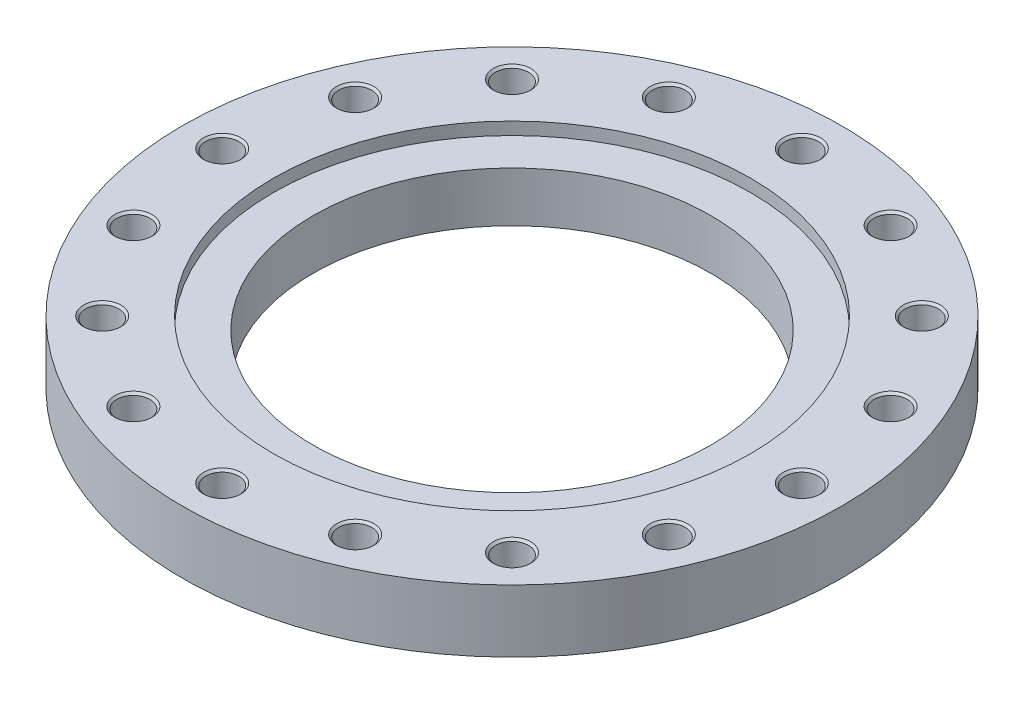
ISO-10303-21;
HEADER;
FILE_DESCRIPTION(('STEP AP214'),'2;1');
FILE_NAME('part.step','',(''),(''),'','','');
FILE_SCHEMA(('AUTOMOTIVE_DESIGN { 1 0 10303 214 1 1 1 1 }'));
ENDSEC;
DATA;
#1=APPLICATION_CONTEXT('core data for automotive mechanical design processes');
#2=APPLICATION_PROTOCOL_DEFINITION('international standard','automotive_design',2000,#1);
#3=PRODUCT_CONTEXT('',#1,'mechanical');
#4=PRODUCT('Part','Part','',(#3));
#5=PRODUCT_RELATED_PRODUCT_CATEGORY('part','',(#4));
#6=PRODUCT_DEFINITION_FORMATION('','',#4);
#7=PRODUCT_DEFINITION_CONTEXT('part definition',#1,'design');
#8=PRODUCT_DEFINITION('design','',#6,#7);
#9=PRODUCT_DEFINITION_SHAPE('','',#8);
#10=(LENGTH_UNIT() NAMED_UNIT(*) SI_UNIT(.MILLI.,.METRE.));
#11=(NAMED_UNIT(*) PLANE_ANGLE_UNIT() SI_UNIT($,.RADIAN.));
#12=(NAMED_UNIT(*) SI_UNIT($,.STERADIAN.) SOLID_ANGLE_UNIT());
#13=UNCERTAINTY_MEASURE_WITH_UNIT(LENGTH_MEASURE(1.E-05),#10,'distance_accuracy_value','');
#14=(GEOMETRIC_REPRESENTATION_CONTEXT(3) GLOBAL_UNCERTAINTY_ASSIGNED_CONTEXT((#13)) GLOBAL_UNIT_ASSIGNED_CONTEXT((#10,
#11,#12)) REPRESENTATION_CONTEXT('',''));
#15=CARTESIAN_POINT('',(0.,0.,0.));
#16=DIRECTION('',(0.,0.,1.));
#17=DIRECTION('',(1.,0.,0.));
#18=AXIS2_PLACEMENT_3D('',#15,#16,#17);
#19=CARTESIAN_POINT('',(0.,27.5,0.));
#20=DIRECTION('',(0.,-1.,0.));
#21=DIRECTION('',(1.,0.,0.));
#22=AXIS2_PLACEMENT_3D('',#19,#20,#21);
#23=CYLINDRICAL_SURFACE('',#22,290.);
#24=CARTESIAN_POINT('',(0.,0.,0.));
#25=DIRECTION('',(0.,1.,0.));
#26=DIRECTION('',(1.,0.,0.));
#27=AXIS2_PLACEMENT_3D('',#24,#25,#26);
#28=CIRCLE('',#27,290.);
#29=CARTESIAN_POINT('',(290.,0.,0.));
#30=VERTEX_POINT('',#29);
#31=EDGE_CURVE('E9',#30,#30,#28,.T.);
#32=ORIENTED_EDGE('',*,*,#31,.T.);
#33=EDGE_LOOP('',(#32));
#34=FACE_BOUND('',#33,.T.);
#35=CARTESIAN_POINT('',(0.,55.,0.));
#36=DIRECTION('',(0.,1.,0.));
#37=DIRECTION('',(1.,0.,0.));
#38=AXIS2_PLACEMENT_3D('',#35,#36,#37);
#39=CIRCLE('',#38,290.);
#40=CARTESIAN_POINT('',(290.,55.,0.));
#41=VERTEX_POINT('',#40);
#42=EDGE_CURVE('E367',#41,#41,#39,.T.);
#43=ORIENTED_EDGE('',*,*,#42,.F.);
#44=EDGE_LOOP('',(#43));
#45=FACE_BOUND('',#44,.T.);
#46=ADVANCED_FACE('F15',(#34,#45),#23,.T.);
#47=CARTESIAN_POINT('',(232.5,0.,0.));
#48=DIRECTION('',(0.,-1.,0.));
#49=DIRECTION('',(-1.,0.,0.));
#50=AXIS2_PLACEMENT_3D('',#47,#48,#49);
#51=PLANE('',#50);
#52=CARTESIAN_POINT('',(0.,0.,0.));
#53=DIRECTION('',(0.,1.,0.));
#54=DIRECTION('',(1.,0.,0.));
#55=AXIS2_PLACEMENT_3D('',#52,#53,#54);
#56=CIRCLE('',#55,175.);
#57=CARTESIAN_POINT('',(175.,0.,0.));
#58=VERTEX_POINT('',#57);
#59=EDGE_CURVE('E25',#58,#58,#56,.T.);
#60=ORIENTED_EDGE('',*,*,#59,.T.);
#61=EDGE_LOOP('',(#60));
#62=FACE_BOUND('',#61,.T.);
#63=ORIENTED_EDGE('',*,*,#31,.F.);
#64=EDGE_LOOP('',(#63));
#65=FACE_BOUND('',#64,.T.);
#66=ADVANCED_FACE('F17',(#62,#65),#51,.T.);
#67=CARTESIAN_POINT('',(0.,27.5,0.));
#68=DIRECTION('',(0.,-1.,0.));
#69=DIRECTION('',(1.,0.,0.));
#70=AXIS2_PLACEMENT_3D('',#67,#68,#69);
#71=CYLINDRICAL_SURFACE('',#70,175.);
#72=ORIENTED_EDGE('',*,*,#59,.F.);
#73=EDGE_LOOP('',(#72));
#74=FACE_BOUND('',#73,.T.);
#75=CARTESIAN_POINT('',(0.,44.,0.));
#76=DIRECTION('',(0.,1.,0.));
#77=DIRECTION('',(1.,0.,0.));
#78=AXIS2_PLACEMENT_3D('',#75,#76,#77);
#79=CIRCLE('',#78,175.);
#80=CARTESIAN_POINT('',(-175.,44.,0.));
#81=VERTEX_POINT('',#80);
#82=EDGE_CURVE('E811',#81,#81,#79,.T.);
#83=ORIENTED_EDGE('',*,*,#82,.T.);
#84=EDGE_LOOP('',(#83));
#85=FACE_BOUND('',#84,.T.);
#86=ADVANCED_FACE('F433',(#74,#85),#71,.F.);
#87=CARTESIAN_POINT('',(232.5,55.,0.));
#88=DIRECTION('',(0.,1.,0.));
#89=DIRECTION('',(1.,0.,0.));
#90=AXIS2_PLACEMENT_3D('',#87,#88,#89);
#91=PLANE('',#90);
#92=ORIENTED_EDGE('',*,*,#42,.T.);
#93=EDGE_LOOP('',(#92));
#94=FACE_BOUND('',#93,.T.);
#95=CARTESIAN_POINT('',(0.,55.,0.));
#96=DIRECTION('',(0.,-1.,0.));
#97=DIRECTION('',(1.,0.,0.));
#98=AXIS2_PLACEMENT_3D('',#95,#96,#97);
#99=CIRCLE('',#98,210.);
#100=CARTESIAN_POINT('',(-210.,55.,0.));
#101=VERTEX_POINT('',#100);
#102=EDGE_CURVE('E95',#101,#101,#99,.T.);
#103=ORIENTED_EDGE('',*,*,#102,.T.);
#104=EDGE_LOOP('',(#103));
#105=FACE_BOUND('',#104,.T.);
#106=CARTESIAN_POINT('',(255.,55.,0.));
#107=DIRECTION('',(0.,-1.,0.));
#108=DIRECTION('',(1.,0.,0.));
#109=AXIS2_PLACEMENT_3D('',#106,#107,#108);
#110=CIRCLE('',#109,16.5);
#111=CARTESIAN_POINT('',(271.5,55.,0.));
#112=VERTEX_POINT('',#111);
#113=EDGE_CURVE('E380',#112,#112,#110,.T.);
#114=ORIENTED_EDGE('',*,*,#113,.T.);
#115=EDGE_LOOP('',(#114));
#116=FACE_BOUND('',#115,.T.);
#117=CARTESIAN_POINT('',(235.589280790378,55.,-97.5842752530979));
#118=DIRECTION('',(0.,-1.,0.));
#119=DIRECTION('',(0.923879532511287,0.,-0.38268343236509));
#120=AXIS2_PLACEMENT_3D('',#117,#118,#119);
#121=CIRCLE('',#120,16.5);
#122=CARTESIAN_POINT('',(250.833293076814,55.,-103.898551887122));
#123=VERTEX_POINT('',#122);
#124=EDGE_CURVE('E370',#123,#123,#121,.T.);
#125=ORIENTED_EDGE('',*,*,#124,.T.);
#126=EDGE_LOOP('',(#125));
#127=FACE_BOUND('',#126,.T.);
#128=CARTESIAN_POINT('',(180.31222920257,55.,-180.31222920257));
#129=DIRECTION('',(0.,-1.,0.));
#130=DIRECTION('',(0.707106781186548,0.,-0.707106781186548));
#131=AXIS2_PLACEMENT_3D('',#128,#129,#130);
#132=CIRCLE('',#131,16.5);
#133=CARTESIAN_POINT('',(191.979491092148,55.,-191.979491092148));
#134=VERTEX_POINT('',#133);
#135=EDGE_CURVE('E358',#134,#134,#132,.T.);
#136=ORIENTED_EDGE('',*,*,#135,.T.);
#137=EDGE_LOOP('',(#136));
#138=FACE_BOUND('',#137,.T.);
#139=CARTESIAN_POINT('',(97.5842752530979,55.,-235.589280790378));
#140=DIRECTION('',(0.,-1.,0.));
#141=DIRECTION('',(0.38268343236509,0.,-0.923879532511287));
#142=AXIS2_PLACEMENT_3D('',#139,#140,#141);
#143=CIRCLE('',#142,16.5);
#144=CARTESIAN_POINT('',(103.898551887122,55.,-250.833293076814));
#145=VERTEX_POINT('',#144);
#146=EDGE_CURVE('E340',#145,#145,#143,.T.);
#147=ORIENTED_EDGE('',*,*,#146,.T.);
#148=EDGE_LOOP('',(#147));
#149=FACE_BOUND('',#148,.T.);
#150=CARTESIAN_POINT('',(0.,55.,-255.));
#151=DIRECTION('',(0.,-1.,0.));
#152=DIRECTION('',(0.,0.,-1.));
#153=AXIS2_PLACEMENT_3D('',#150,#151,#152);
#154=CIRCLE('',#153,16.5);
#155=CARTESIAN_POINT('',(0.,55.,-271.5));
#156=VERTEX_POINT('',#155);
#157=EDGE_CURVE('E402',#156,#156,#154,.T.);
#158=ORIENTED_EDGE('',*,*,#157,.T.);
#159=EDGE_LOOP('',(#158));
#160=FACE_BOUND('',#159,.T.);
#161=CARTESIAN_POINT('',(-97.5842752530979,55.,-235.589280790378));
#162=DIRECTION('',(0.,-1.,0.));
#163=DIRECTION('',(-0.38268343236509,0.,-0.923879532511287));
#164=AXIS2_PLACEMENT_3D('',#161,#162,#163);
#165=CIRCLE('',#164,16.5);
#166=CARTESIAN_POINT('',(-103.898551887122,55.,-250.833293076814));
#167=VERTEX_POINT('',#166);
#168=EDGE_CURVE('E391',#167,#167,#165,.T.);
#169=ORIENTED_EDGE('',*,*,#168,.T.);
#170=EDGE_LOOP('',(#169));
#171=FACE_BOUND('',#170,.T.);
#172=CARTESIAN_POINT('',(-180.31222920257,55.,-180.31222920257));
#173=DIRECTION('',(0.,-1.,0.));
#174=DIRECTION('',(-0.707106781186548,0.,-0.707106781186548));
#175=AXIS2_PLACEMENT_3D('',#172,#173,#174);
#176=CIRCLE('',#175,16.5);
#177=CARTESIAN_POINT('',(-191.979491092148,55.,-191.979491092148));
#178=VERTEX_POINT('',#177);
#179=EDGE_CURVE('E826',#178,#178,#176,.T.);
#180=ORIENTED_EDGE('',*,*,#179,.T.);
#181=EDGE_LOOP('',(#180));
#182=FACE_BOUND('',#181,.T.);
#183=CARTESIAN_POINT('',(-235.589280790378,55.,-97.5842752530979));
#184=DIRECTION('',(0.,-1.,0.));
#185=DIRECTION('',(-0.923879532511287,0.,-0.38268343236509));
#186=AXIS2_PLACEMENT_3D('',#183,#184,#185);
#187=CIRCLE('',#186,16.5);
#188=CARTESIAN_POINT('',(-250.833293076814,55.,-103.898551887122));
#189=VERTEX_POINT('',#188);
#190=EDGE_CURVE('E814',#189,#189,#187,.T.);
#191=ORIENTED_EDGE('',*,*,#190,.T.);
#192=EDGE_LOOP('',(#191));
#193=FACE_BOUND('',#192,.T.);
#194=CARTESIAN_POINT('',(-255.,55.,0.));
#195=DIRECTION('',(0.,-1.,0.));
#196=DIRECTION('',(-1.,0.,0.));
#197=AXIS2_PLACEMENT_3D('',#194,#195,#196);
#198=CIRCLE('',#197,16.5);
#199=CARTESIAN_POINT('',(-271.5,55.,0.));
#200=VERTEX_POINT('',#199);
#201=EDGE_CURVE('E801',#200,#200,#198,.T.);
#202=ORIENTED_EDGE('',*,*,#201,.T.);
#203=EDGE_LOOP('',(#202));
#204=FACE_BOUND('',#203,.T.);
#205=CARTESIAN_POINT('',(-235.589280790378,55.,97.5842752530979));
#206=DIRECTION('',(0.,-1.,0.));
#207=DIRECTION('',(-0.923879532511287,0.,0.38268343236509));
#208=AXIS2_PLACEMENT_3D('',#205,#206,#207);
#209=CIRCLE('',#208,16.5);
#210=CARTESIAN_POINT('',(-250.833293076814,55.,103.898551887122));
#211=VERTEX_POINT('',#210);
#212=EDGE_CURVE('E790',#211,#211,#209,.T.);
#213=ORIENTED_EDGE('',*,*,#212,.T.);
#214=EDGE_LOOP('',(#213));
#215=FACE_BOUND('',#214,.T.);
#216=CARTESIAN_POINT('',(-180.31222920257,55.,180.31222920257));
#217=DIRECTION('',(0.,-1.,0.));
#218=DIRECTION('',(-0.707106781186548,0.,0.707106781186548));
#219=AXIS2_PLACEMENT_3D('',#216,#217,#218);
#220=CIRCLE('',#219,16.5);
#221=CARTESIAN_POINT('',(-191.979491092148,55.,191.979491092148));
#222=VERTEX_POINT('',#221);
#223=EDGE_CURVE('E889',#222,#222,#220,.T.);
#224=ORIENTED_EDGE('',*,*,#223,.T.);
#225=EDGE_LOOP('',(#224));
#226=FACE_BOUND('',#225,.T.);
#227=CARTESIAN_POINT('',(-97.584275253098,55.,235.589280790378));
#228=DIRECTION('',(0.,-1.,0.));
#229=DIRECTION('',(-0.382683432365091,0.,0.923879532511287));
#230=AXIS2_PLACEMENT_3D('',#227,#228,#229);
#231=CIRCLE('',#230,16.5);
#232=CARTESIAN_POINT('',(-103.898551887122,55.,250.833293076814));
#233=VERTEX_POINT('',#232);
#234=EDGE_CURVE('E874',#233,#233,#231,.T.);
#235=ORIENTED_EDGE('',*,*,#234,.T.);
#236=EDGE_LOOP('',(#235));
#237=FACE_BOUND('',#236,.T.);
#238=CARTESIAN_POINT('',(0.,55.,255.));
#239=DIRECTION('',(0.,-1.,0.));
#240=DIRECTION('',(0.,0.,1.));
#241=AXIS2_PLACEMENT_3D('',#238,#239,#240);
#242=CIRCLE('',#241,16.5);
#243=CARTESIAN_POINT('',(0.,55.,271.5));
#244=VERTEX_POINT('',#243);
#245=EDGE_CURVE('E861',#244,#244,#242,.T.);
#246=ORIENTED_EDGE('',*,*,#245,.T.);
#247=EDGE_LOOP('',(#246));
#248=FACE_BOUND('',#247,.T.);
#249=CARTESIAN_POINT('',(97.5842752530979,55.,235.589280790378));
#250=DIRECTION('',(0.,-1.,0.));
#251=DIRECTION('',(0.38268343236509,0.,0.923879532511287));
#252=AXIS2_PLACEMENT_3D('',#249,#250,#251);
#253=CIRCLE('',#252,16.5);
#254=CARTESIAN_POINT('',(103.898551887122,55.,250.833293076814));
#255=VERTEX_POINT('',#254);
#256=EDGE_CURVE('E845',#255,#255,#253,.T.);
#257=ORIENTED_EDGE('',*,*,#256,.T.);
#258=EDGE_LOOP('',(#257));
#259=FACE_BOUND('',#258,.T.);
#260=CARTESIAN_POINT('',(180.31222920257,55.,180.31222920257));
#261=DIRECTION('',(0.,-1.,0.));
#262=DIRECTION('',(0.707106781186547,0.,0.707106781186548));
#263=AXIS2_PLACEMENT_3D('',#260,#261,#262);
#264=CIRCLE('',#263,16.5);
#265=CARTESIAN_POINT('',(191.979491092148,55.,191.979491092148));
#266=VERTEX_POINT('',#265);
#267=EDGE_CURVE('E948',#266,#266,#264,.T.);
#268=ORIENTED_EDGE('',*,*,#267,.T.);
#269=EDGE_LOOP('',(#268));
#270=FACE_BOUND('',#269,.T.);
#271=CARTESIAN_POINT('',(235.589280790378,55.,97.5842752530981));
#272=DIRECTION('',(0.,-1.,0.));
#273=DIRECTION('',(0.923879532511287,0.,0.382683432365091));
#274=AXIS2_PLACEMENT_3D('',#271,#272,#273);
#275=CIRCLE('',#274,16.5);
#276=CARTESIAN_POINT('',(250.833293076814,55.,103.898551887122));
#277=VERTEX_POINT('',#276);
#278=EDGE_CURVE('E915',#277,#277,#275,.T.);
#279=ORIENTED_EDGE('',*,*,#278,.T.);
#280=EDGE_LOOP('',(#279));
#281=FACE_BOUND('',#280,.T.);
#282=ADVANCED_FACE('F341',(#94,#105,#116,#127,#138,#149,#160,#171,#182,#193,#204,#215,#226,#237,
#248,#259,#270,#281),#91,.T.);
#283=CARTESIAN_POINT('',(0.,44.,0.));
#284=DIRECTION('',(0.,-1.,0.));
#285=DIRECTION('',(-1.,0.,0.));
#286=AXIS2_PLACEMENT_3D('',#283,#284,#285);
#287=PLANE('',#286);
#288=CARTESIAN_POINT('',(0.,44.,0.));
#289=DIRECTION('',(0.,-1.,0.));
#290=DIRECTION('',(1.,0.,0.));
#291=AXIS2_PLACEMENT_3D('',#288,#289,#290);
#292=CIRCLE('',#291,210.);
#293=CARTESIAN_POINT('',(210.,44.,0.));
#294=VERTEX_POINT('',#293);
#295=EDGE_CURVE('E89',#294,#294,#292,.T.);
#296=ORIENTED_EDGE('',*,*,#295,.F.);
#297=EDGE_LOOP('',(#296));
#298=FACE_BOUND('',#297,.T.);
#299=ORIENTED_EDGE('',*,*,#82,.F.);
#300=EDGE_LOOP('',(#299));
#301=FACE_BOUND('',#300,.T.);
#302=ADVANCED_FACE('F554',(#298,#301),#287,.F.);
#303=CARTESIAN_POINT('',(0.,52.25,0.));
#304=DIRECTION('',(0.,-1.,0.));
#305=DIRECTION('',(1.,0.,0.));
#306=AXIS2_PLACEMENT_3D('',#303,#304,#305);
#307=CYLINDRICAL_SURFACE('',#306,210.);
#308=ORIENTED_EDGE('',*,*,#295,.T.);
#309=EDGE_LOOP('',(#308));
#310=FACE_BOUND('',#309,.T.);
#311=ORIENTED_EDGE('',*,*,#102,.F.);
#312=EDGE_LOOP('',(#311));
#313=FACE_BOUND('',#312,.T.);
#314=ADVANCED_FACE('F1064',(#310,#313),#307,.F.);
#315=CARTESIAN_POINT('',(255.,7.78371923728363,0.));
#316=DIRECTION('',(0.,1.,0.));
#317=DIRECTION('',(1.,0.,0.));
#318=AXIS2_PLACEMENT_3D('',#315,#316,#317);
#319=CONICAL_SURFACE('',#318,7.3028125,1.0471975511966);
#320=CARTESIAN_POINT('',(255.,12.,0.));
#321=DIRECTION('',(0.,-1.,0.));
#322=DIRECTION('',(1.,0.,0.));
#323=AXIS2_PLACEMENT_3D('',#320,#321,#322);
#324=CIRCLE('',#323,14.605625);
#325=CARTESIAN_POINT('',(269.605625,12.,0.));
#326=VERTEX_POINT('',#325);
#327=EDGE_CURVE('E19',#326,#326,#324,.T.);
#328=ORIENTED_EDGE('',*,*,#327,.F.);
#329=EDGE_LOOP('',(#328));
#330=FACE_BOUND('',#329,.T.);
#331=CARTESIAN_POINT('',(255.,3.56743847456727,0.));
#332=VERTEX_POINT('',#331);
#333=VERTEX_LOOP('',#332);
#334=FACE_BOUND('',#333,.T.);
#335=ADVANCED_FACE('F531',(#330,#334),#319,.F.);
#336=CARTESIAN_POINT('',(255.,16.5528125,0.));
#337=DIRECTION('',(0.,1.,0.));
#338=DIRECTION('',(1.,0.,0.));
#339=AXIS2_PLACEMENT_3D('',#336,#337,#338);
#340=CYLINDRICAL_SURFACE('',#339,14.605625);
#341=CARTESIAN_POINT('',(255.,21.105625,0.));
#342=DIRECTION('',(0.,-1.,0.));
#343=DIRECTION('',(1.,0.,0.));
#344=AXIS2_PLACEMENT_3D('',#341,#342,#343);
#345=CIRCLE('',#344,14.605625);
#346=CARTESIAN_POINT('',(269.605625,21.105625,0.));
#347=VERTEX_POINT('',#346);
#348=EDGE_CURVE('E383',#347,#347,#345,.T.);
#349=ORIENTED_EDGE('',*,*,#348,.F.);
#350=EDGE_LOOP('',(#349));
#351=FACE_BOUND('',#350,.T.);
#352=ORIENTED_EDGE('',*,*,#327,.T.);
#353=EDGE_LOOP('',(#352));
#354=FACE_BOUND('',#353,.T.);
#355=ADVANCED_FACE('F527',(#351,#354),#340,.F.);
#356=CARTESIAN_POINT('',(255.,22.0528125,0.));
#357=DIRECTION('',(0.,1.,0.));
#358=DIRECTION('',(1.,0.,0.));
#359=AXIS2_PLACEMENT_3D('',#356,#357,#358);
#360=CONICAL_SURFACE('',#359,15.5528125,0.785398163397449);
#361=CARTESIAN_POINT('',(255.,23.,0.));
#362=DIRECTION('',(0.,-1.,0.));
#363=DIRECTION('',(1.,0.,0.));
#364=AXIS2_PLACEMENT_3D('',#361,#362,#363);
#365=CIRCLE('',#364,16.5);
#366=CARTESIAN_POINT('',(271.5,23.,0.));
#367=VERTEX_POINT('',#366);
#368=EDGE_CURVE('E379',#367,#367,#365,.T.);
#369=ORIENTED_EDGE('',*,*,#368,.F.);
#370=EDGE_LOOP('',(#369));
#371=FACE_BOUND('',#370,.T.);
#372=ORIENTED_EDGE('',*,*,#348,.T.);
#373=EDGE_LOOP('',(#372));
#374=FACE_BOUND('',#373,.T.);
#375=ADVANCED_FACE('F530',(#371,#374),#360,.F.);
#376=CARTESIAN_POINT('',(270.5528125,23.,0.));
#377=DIRECTION('',(0.,1.,0.));
#378=DIRECTION('',(-1.,0.,0.));
#379=AXIS2_PLACEMENT_3D('',#376,#377,#378);
#380=PLANE('',#379);
#381=CARTESIAN_POINT('',(255.,23.,0.));
#382=DIRECTION('',(0.,-1.,0.));
#383=DIRECTION('',(1.,0.,0.));
#384=AXIS2_PLACEMENT_3D('',#381,#382,#383);
#385=CIRCLE('',#384,14.605625);
#386=CARTESIAN_POINT('',(269.605625,23.,0.));
#387=VERTEX_POINT('',#386);
#388=EDGE_CURVE('E378',#387,#387,#385,.T.);
#389=ORIENTED_EDGE('',*,*,#388,.F.);
#390=EDGE_LOOP('',(#389));
#391=FACE_BOUND('',#390,.T.);
#392=ORIENTED_EDGE('',*,*,#368,.T.);
#393=EDGE_LOOP('',(#392));
#394=FACE_BOUND('',#393,.T.);
#395=ADVANCED_FACE('F594',(#391,#394),#380,.F.);
#396=CARTESIAN_POINT('',(255.,38.0528125,0.));
#397=DIRECTION('',(0.,1.,0.));
#398=DIRECTION('',(1.,0.,0.));
#399=AXIS2_PLACEMENT_3D('',#396,#397,#398);
#400=CYLINDRICAL_SURFACE('',#399,14.605625);
#401=CARTESIAN_POINT('',(255.,53.105625,0.));
#402=DIRECTION('',(0.,-1.,0.));
#403=DIRECTION('',(1.,0.,0.));
#404=AXIS2_PLACEMENT_3D('',#401,#402,#403);
#405=CIRCLE('',#404,14.605625);
#406=CARTESIAN_POINT('',(269.605625,53.105625,0.));
#407=VERTEX_POINT('',#406);
#408=EDGE_CURVE('E377',#407,#407,#405,.T.);
#409=ORIENTED_EDGE('',*,*,#408,.F.);
#410=EDGE_LOOP('',(#409));
#411=FACE_BOUND('',#410,.T.);
#412=ORIENTED_EDGE('',*,*,#388,.T.);
#413=EDGE_LOOP('',(#412));
#414=FACE_BOUND('',#413,.T.);
#415=ADVANCED_FACE('F597',(#411,#414),#400,.F.);
#416=CARTESIAN_POINT('',(255.,54.0528125,0.));
#417=DIRECTION('',(0.,1.,0.));
#418=DIRECTION('',(1.,0.,0.));
#419=AXIS2_PLACEMENT_3D('',#416,#417,#418);
#420=CONICAL_SURFACE('',#419,15.5528125,0.785398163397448);
#421=ORIENTED_EDGE('',*,*,#113,.F.);
#422=EDGE_LOOP('',(#421));
#423=FACE_BOUND('',#422,.T.);
#424=ORIENTED_EDGE('',*,*,#408,.T.);
#425=EDGE_LOOP('',(#424));
#426=FACE_BOUND('',#425,.T.);
#427=ADVANCED_FACE('F651',(#423,#426),#420,.F.);
#428=CARTESIAN_POINT('',(235.589280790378,7.78371923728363,-97.5842752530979));
#429=DIRECTION('',(0.,1.,0.));
#430=DIRECTION('',(0.923879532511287,0.,-0.38268343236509));
#431=AXIS2_PLACEMENT_3D('',#428,#429,#430);
#432=CONICAL_SURFACE('',#431,7.3028125,1.0471975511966);
#433=CARTESIAN_POINT('',(235.589280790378,12.,-97.5842752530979));
#434=DIRECTION('',(0.,-1.,0.));
#435=DIRECTION('',(0.923879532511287,0.,-0.38268343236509));
#436=AXIS2_PLACEMENT_3D('',#433,#434,#435);
#437=CIRCLE('',#436,14.605625);
#438=CARTESIAN_POINT('',(249.083118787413,12.,-103.173605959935));
#439=VERTEX_POINT('',#438);
#440=EDGE_CURVE('E376',#439,#439,#437,.T.);
#441=ORIENTED_EDGE('',*,*,#440,.F.);
#442=EDGE_LOOP('',(#441));
#443=FACE_BOUND('',#442,.T.);
#444=CARTESIAN_POINT('',(235.589280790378,3.56743847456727,-97.5842752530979));
#445=VERTEX_POINT('',#444);
#446=VERTEX_LOOP('',#445);
#447=FACE_BOUND('',#446,.T.);
#448=ADVANCED_FACE('F719',(#443,#447),#432,.F.);
#449=CARTESIAN_POINT('',(235.589280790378,16.5528125,-97.5842752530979));
#450=DIRECTION('',(0.,1.,0.));
#451=DIRECTION('',(0.923879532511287,0.,-0.38268343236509));
#452=AXIS2_PLACEMENT_3D('',#449,#450,#451);
#453=CYLINDRICAL_SURFACE('',#452,14.605625);
#454=CARTESIAN_POINT('',(235.589280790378,21.105625,-97.5842752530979));
#455=DIRECTION('',(0.,-1.,0.));
#456=DIRECTION('',(0.923879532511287,0.,-0.38268343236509));
#457=AXIS2_PLACEMENT_3D('',#454,#455,#456);
#458=CIRCLE('',#457,14.605625);
#459=CARTESIAN_POINT('',(249.083118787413,21.105625,-103.173605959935));
#460=VERTEX_POINT('',#459);
#461=EDGE_CURVE('E375',#460,#460,#458,.T.);
#462=ORIENTED_EDGE('',*,*,#461,.F.);
#463=EDGE_LOOP('',(#462));
#464=FACE_BOUND('',#463,.T.);
#465=ORIENTED_EDGE('',*,*,#440,.T.);
#466=EDGE_LOOP('',(#465));
#467=FACE_BOUND('',#466,.T.);
#468=ADVANCED_FACE('F716',(#464,#467),#453,.F.);
#469=CARTESIAN_POINT('',(235.589280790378,22.0528125,-97.5842752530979));
#470=DIRECTION('',(0.,1.,0.));
#471=DIRECTION('',(0.923879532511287,0.,-0.38268343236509));
#472=AXIS2_PLACEMENT_3D('',#469,#470,#471);
#473=CONICAL_SURFACE('',#472,15.5528125,0.785398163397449);
#474=CARTESIAN_POINT('',(235.589280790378,23.,-97.5842752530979));
#475=DIRECTION('',(0.,-1.,0.));
#476=DIRECTION('',(0.923879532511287,0.,-0.38268343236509));
#477=AXIS2_PLACEMENT_3D('',#474,#475,#476);
#478=CIRCLE('',#477,16.5);
#479=CARTESIAN_POINT('',(250.833293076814,23.,-103.898551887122));
#480=VERTEX_POINT('',#479);
#481=EDGE_CURVE('E373',#480,#480,#478,.T.);
#482=ORIENTED_EDGE('',*,*,#481,.F.);
#483=EDGE_LOOP('',(#482));
#484=FACE_BOUND('',#483,.T.);
#485=ORIENTED_EDGE('',*,*,#461,.T.);
#486=EDGE_LOOP('',(#485));
#487=FACE_BOUND('',#486,.T.);
#488=ADVANCED_FACE('F677',(#484,#487),#473,.F.);
#489=CARTESIAN_POINT('',(249.958205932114,23.,-103.536078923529));
#490=DIRECTION('',(0.,1.,0.));
#491=DIRECTION('',(-0.923879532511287,0.,0.38268343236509));
#492=AXIS2_PLACEMENT_3D('',#489,#490,#491);
#493=PLANE('',#492);
#494=CARTESIAN_POINT('',(235.589280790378,23.,-97.5842752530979));
#495=DIRECTION('',(0.,-1.,0.));
#496=DIRECTION('',(0.923879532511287,0.,-0.38268343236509));
#497=AXIS2_PLACEMENT_3D('',#494,#495,#496);
#498=CIRCLE('',#497,14.605625);
#499=CARTESIAN_POINT('',(249.083118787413,23.,-103.173605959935));
#500=VERTEX_POINT('',#499);
#501=EDGE_CURVE('E372',#500,#500,#498,.T.);
#502=ORIENTED_EDGE('',*,*,#501,.F.);
#503=EDGE_LOOP('',(#502));
#504=FACE_BOUND('',#503,.T.);
#505=ORIENTED_EDGE('',*,*,#481,.T.);
#506=EDGE_LOOP('',(#505));
#507=FACE_BOUND('',#506,.T.);
#508=ADVANCED_FACE('F673',(#504,#507),#493,.F.);
#509=CARTESIAN_POINT('',(235.589280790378,38.0528125,-97.5842752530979));
#510=DIRECTION('',(0.,1.,0.));
#511=DIRECTION('',(0.923879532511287,0.,-0.38268343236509));
#512=AXIS2_PLACEMENT_3D('',#509,#510,#511);
#513=CYLINDRICAL_SURFACE('',#512,14.605625);
#514=CARTESIAN_POINT('',(235.589280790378,53.105625,-97.5842752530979));
#515=DIRECTION('',(0.,-1.,0.));
#516=DIRECTION('',(0.923879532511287,0.,-0.38268343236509));
#517=AXIS2_PLACEMENT_3D('',#514,#515,#516);
#518=CIRCLE('',#517,14.605625);
#519=CARTESIAN_POINT('',(249.083118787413,53.105625,-103.173605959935));
#520=VERTEX_POINT('',#519);
#521=EDGE_CURVE('E368',#520,#520,#518,.T.);
#522=ORIENTED_EDGE('',*,*,#521,.F.);
#523=EDGE_LOOP('',(#522));
#524=FACE_BOUND('',#523,.T.);
#525=ORIENTED_EDGE('',*,*,#501,.T.);
#526=EDGE_LOOP('',(#525));
#527=FACE_BOUND('',#526,.T.);
#528=ADVANCED_FACE('F676',(#524,#527),#513,.F.);
#529=CARTESIAN_POINT('',(235.589280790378,54.0528125,-97.5842752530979));
#530=DIRECTION('',(0.,1.,0.));
#531=DIRECTION('',(0.923879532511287,0.,-0.38268343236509));
#532=AXIS2_PLACEMENT_3D('',#529,#530,#531);
#533=CONICAL_SURFACE('',#532,15.5528125,0.785398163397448);
#534=ORIENTED_EDGE('',*,*,#124,.F.);
#535=EDGE_LOOP('',(#534));
#536=FACE_BOUND('',#535,.T.);
#537=ORIENTED_EDGE('',*,*,#521,.T.);
#538=EDGE_LOOP('',(#537));
#539=FACE_BOUND('',#538,.T.);
#540=ADVANCED_FACE('F622',(#536,#539),#533,.F.);
#541=CARTESIAN_POINT('',(180.31222920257,7.78371923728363,-180.31222920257));
#542=DIRECTION('',(0.,1.,0.));
#543=DIRECTION('',(0.707106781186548,0.,-0.707106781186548));
#544=AXIS2_PLACEMENT_3D('',#541,#542,#543);
#545=CONICAL_SURFACE('',#544,7.3028125,1.0471975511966);
#546=CARTESIAN_POINT('',(180.31222920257,12.,-180.31222920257));
#547=DIRECTION('',(0.,-1.,0.));
#548=DIRECTION('',(0.707106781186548,0.,-0.707106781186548));
#549=AXIS2_PLACEMENT_3D('',#546,#547,#548);
#550=CIRCLE('',#549,14.605625);
#551=CARTESIAN_POINT('',(190.639965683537,12.,-190.639965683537));
#552=VERTEX_POINT('',#551);
#553=EDGE_CURVE('E365',#552,#552,#550,.T.);
#554=ORIENTED_EDGE('',*,*,#553,.F.);
#555=EDGE_LOOP('',(#554));
#556=FACE_BOUND('',#555,.T.);
#557=CARTESIAN_POINT('',(180.31222920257,3.56743847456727,-180.31222920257));
#558=VERTEX_POINT('',#557);
#559=VERTEX_LOOP('',#558);
#560=FACE_BOUND('',#559,.T.);
#561=ADVANCED_FACE('F618',(#556,#560),#545,.F.);
#562=CARTESIAN_POINT('',(180.31222920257,16.5528125,-180.31222920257));
#563=DIRECTION('',(0.,1.,0.));
#564=DIRECTION('',(0.707106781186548,0.,-0.707106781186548));
#565=AXIS2_PLACEMENT_3D('',#562,#563,#564);
#566=CYLINDRICAL_SURFACE('',#565,14.605625);
#567=CARTESIAN_POINT('',(180.31222920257,21.105625,-180.31222920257));
#568=DIRECTION('',(0.,-1.,0.));
#569=DIRECTION('',(0.707106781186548,0.,-0.707106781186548));
#570=AXIS2_PLACEMENT_3D('',#567,#568,#569);
#571=CIRCLE('',#570,14.605625);
#572=CARTESIAN_POINT('',(190.639965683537,21.105625,-190.639965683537));
#573=VERTEX_POINT('',#572);
#574=EDGE_CURVE('E363',#573,#573,#571,.T.);
#575=ORIENTED_EDGE('',*,*,#574,.F.);
#576=EDGE_LOOP('',(#575));
#577=FACE_BOUND('',#576,.T.);
#578=ORIENTED_EDGE('',*,*,#553,.T.);
#579=EDGE_LOOP('',(#578));
#580=FACE_BOUND('',#579,.T.);
#581=ADVANCED_FACE('F621',(#577,#580),#566,.F.);
#582=CARTESIAN_POINT('',(180.31222920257,22.0528125,-180.31222920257));
#583=DIRECTION('',(0.,1.,0.));
#584=DIRECTION('',(0.707106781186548,0.,-0.707106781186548));
#585=AXIS2_PLACEMENT_3D('',#582,#583,#584);
#586=CONICAL_SURFACE('',#585,15.5528125,0.785398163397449);
#587=CARTESIAN_POINT('',(180.31222920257,23.,-180.31222920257));
#588=DIRECTION('',(0.,-1.,0.));
#589=DIRECTION('',(0.707106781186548,0.,-0.707106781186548));
#590=AXIS2_PLACEMENT_3D('',#587,#588,#589);
#591=CIRCLE('',#590,16.5);
#592=CARTESIAN_POINT('',(191.979491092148,23.,-191.979491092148));
#593=VERTEX_POINT('',#592);
#594=EDGE_CURVE('E362',#593,#593,#591,.T.);
#595=ORIENTED_EDGE('',*,*,#594,.F.);
#596=EDGE_LOOP('',(#595));
#597=FACE_BOUND('',#596,.T.);
#598=ORIENTED_EDGE('',*,*,#574,.T.);
#599=EDGE_LOOP('',(#598));
#600=FACE_BOUND('',#599,.T.);
#601=ADVANCED_FACE('F690',(#597,#600),#586,.F.);
#602=CARTESIAN_POINT('',(191.309728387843,23.,-191.309728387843));
#603=DIRECTION('',(0.,1.,0.));
#604=DIRECTION('',(-0.707106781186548,0.,0.707106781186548));
#605=AXIS2_PLACEMENT_3D('',#602,#603,#604);
#606=PLANE('',#605);
#607=CARTESIAN_POINT('',(180.31222920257,23.,-180.31222920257));
#608=DIRECTION('',(0.,-1.,0.));
#609=DIRECTION('',(0.707106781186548,0.,-0.707106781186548));
#610=AXIS2_PLACEMENT_3D('',#607,#608,#609);
#611=CIRCLE('',#610,14.605625);
#612=CARTESIAN_POINT('',(190.639965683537,23.,-190.639965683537));
#613=VERTEX_POINT('',#612);
#614=EDGE_CURVE('E360',#613,#613,#611,.T.);
#615=ORIENTED_EDGE('',*,*,#614,.F.);
#616=EDGE_LOOP('',(#615));
#617=FACE_BOUND('',#616,.T.);
#618=ORIENTED_EDGE('',*,*,#594,.T.);
#619=EDGE_LOOP('',(#618));
#620=FACE_BOUND('',#619,.T.);
#621=ADVANCED_FACE('F702',(#617,#620),#606,.F.);
#622=CARTESIAN_POINT('',(180.31222920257,38.0528125,-180.31222920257));
#623=DIRECTION('',(0.,1.,0.));
#624=DIRECTION('',(0.707106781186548,0.,-0.707106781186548));
#625=AXIS2_PLACEMENT_3D('',#622,#623,#624);
#626=CYLINDRICAL_SURFACE('',#625,14.605625);
#627=CARTESIAN_POINT('',(180.31222920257,53.105625,-180.31222920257));
#628=DIRECTION('',(0.,-1.,0.));
#629=DIRECTION('',(0.707106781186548,0.,-0.707106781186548));
#630=AXIS2_PLACEMENT_3D('',#627,#628,#629);
#631=CIRCLE('',#630,14.605625);
#632=CARTESIAN_POINT('',(190.639965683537,53.105625,-190.639965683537));
#633=VERTEX_POINT('',#632);
#634=EDGE_CURVE('E356',#633,#633,#631,.T.);
#635=ORIENTED_EDGE('',*,*,#634,.F.);
#636=EDGE_LOOP('',(#635));
#637=FACE_BOUND('',#636,.T.);
#638=ORIENTED_EDGE('',*,*,#614,.T.);
#639=EDGE_LOOP('',(#638));
#640=FACE_BOUND('',#639,.T.);
#641=ADVANCED_FACE('F1057',(#637,#640),#626,.F.);
#642=CARTESIAN_POINT('',(180.31222920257,54.0528125,-180.31222920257));
#643=DIRECTION('',(0.,1.,0.));
#644=DIRECTION('',(0.707106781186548,0.,-0.707106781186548));
#645=AXIS2_PLACEMENT_3D('',#642,#643,#644);
#646=CONICAL_SURFACE('',#645,15.5528125,0.785398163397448);
#647=ORIENTED_EDGE('',*,*,#135,.F.);
#648=EDGE_LOOP('',(#647));
#649=FACE_BOUND('',#648,.T.);
#650=ORIENTED_EDGE('',*,*,#634,.T.);
#651=EDGE_LOOP('',(#650));
#652=FACE_BOUND('',#651,.T.);
#653=ADVANCED_FACE('F1052',(#649,#652),#646,.F.);
#654=CARTESIAN_POINT('',(97.5842752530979,7.78371923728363,-235.589280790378));
#655=DIRECTION('',(0.,1.,0.));
#656=DIRECTION('',(0.38268343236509,0.,-0.923879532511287));
#657=AXIS2_PLACEMENT_3D('',#654,#655,#656);
#658=CONICAL_SURFACE('',#657,7.3028125,1.0471975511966);
#659=CARTESIAN_POINT('',(97.5842752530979,12.,-235.589280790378));
#660=DIRECTION('',(0.,-1.,0.));
#661=DIRECTION('',(0.38268343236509,0.,-0.923879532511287));
#662=AXIS2_PLACEMENT_3D('',#659,#660,#661);
#663=CIRCLE('',#662,14.605625);
#664=CARTESIAN_POINT('',(103.173605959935,12.,-249.083118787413));
#665=VERTEX_POINT('',#664);
#666=EDGE_CURVE('E354',#665,#665,#663,.T.);
#667=ORIENTED_EDGE('',*,*,#666,.F.);
#668=EDGE_LOOP('',(#667));
#669=FACE_BOUND('',#668,.T.);
#670=CARTESIAN_POINT('',(97.5842752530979,3.56743847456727,-235.589280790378));
#671=VERTEX_POINT('',#670);
#672=VERTEX_LOOP('',#671);
#673=FACE_BOUND('',#672,.T.);
#674=ADVANCED_FACE('F1046',(#669,#673),#658,.F.);
#675=CARTESIAN_POINT('',(97.5842752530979,16.5528125,-235.589280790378));
#676=DIRECTION('',(0.,1.,0.));
#677=DIRECTION('',(0.38268343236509,0.,-0.923879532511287));
#678=AXIS2_PLACEMENT_3D('',#675,#676,#677);
#679=CYLINDRICAL_SURFACE('',#678,14.605625);
#680=CARTESIAN_POINT('',(97.5842752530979,21.105625,-235.589280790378));
#681=DIRECTION('',(0.,-1.,0.));
#682=DIRECTION('',(0.38268343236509,0.,-0.923879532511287));
#683=AXIS2_PLACEMENT_3D('',#680,#681,#682);
#684=CIRCLE('',#683,14.605625);
#685=CARTESIAN_POINT('',(103.173605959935,21.105625,-249.083118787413));
#686=VERTEX_POINT('',#685);
#687=EDGE_CURVE('E352',#686,#686,#684,.T.);
#688=ORIENTED_EDGE('',*,*,#687,.F.);
#689=EDGE_LOOP('',(#688));
#690=FACE_BOUND('',#689,.T.);
#691=ORIENTED_EDGE('',*,*,#666,.T.);
#692=EDGE_LOOP('',(#691));
#693=FACE_BOUND('',#692,.T.);
#694=ADVANCED_FACE('F1040',(#690,#693),#679,.F.);
#695=CARTESIAN_POINT('',(97.5842752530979,22.0528125,-235.589280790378));
#696=DIRECTION('',(0.,1.,0.));
#697=DIRECTION('',(0.38268343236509,0.,-0.923879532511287));
#698=AXIS2_PLACEMENT_3D('',#695,#696,#697);
#699=CONICAL_SURFACE('',#698,15.5528125,0.785398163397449);
#700=CARTESIAN_POINT('',(97.5842752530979,23.,-235.589280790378));
#701=DIRECTION('',(0.,-1.,0.));
#702=DIRECTION('',(0.38268343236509,0.,-0.923879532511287));
#703=AXIS2_PLACEMENT_3D('',#700,#701,#702);
#704=CIRCLE('',#703,16.5);
#705=CARTESIAN_POINT('',(103.898551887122,23.,-250.833293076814));
#706=VERTEX_POINT('',#705);
#707=EDGE_CURVE('E346',#706,#706,#704,.T.);
#708=ORIENTED_EDGE('',*,*,#707,.F.);
#709=EDGE_LOOP('',(#708));
#710=FACE_BOUND('',#709,.T.);
#711=ORIENTED_EDGE('',*,*,#687,.T.);
#712=EDGE_LOOP('',(#711));
#713=FACE_BOUND('',#712,.T.);
#714=ADVANCED_FACE('F1037',(#710,#713),#699,.F.);
#715=CARTESIAN_POINT('',(103.536078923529,23.,-249.958205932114));
#716=DIRECTION('',(0.,1.,0.));
#717=DIRECTION('',(-0.38268343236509,0.,0.923879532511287));
#718=AXIS2_PLACEMENT_3D('',#715,#716,#717);
#719=PLANE('',#718);
#720=CARTESIAN_POINT('',(97.5842752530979,23.,-235.589280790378));
#721=DIRECTION('',(0.,-1.,0.));
#722=DIRECTION('',(0.38268343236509,0.,-0.923879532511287));
#723=AXIS2_PLACEMENT_3D('',#720,#721,#722);
#724=CIRCLE('',#723,14.605625);
#725=CARTESIAN_POINT('',(103.173605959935,23.,-249.083118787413));
#726=VERTEX_POINT('',#725);
#727=EDGE_CURVE('E344',#726,#726,#724,.T.);
#728=ORIENTED_EDGE('',*,*,#727,.F.);
#729=EDGE_LOOP('',(#728));
#730=FACE_BOUND('',#729,.T.);
#731=ORIENTED_EDGE('',*,*,#707,.T.);
#732=EDGE_LOOP('',(#731));
#733=FACE_BOUND('',#732,.T.);
#734=ADVANCED_FACE('F1035',(#730,#733),#719,.F.);
#735=CARTESIAN_POINT('',(97.5842752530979,38.0528125,-235.589280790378));
#736=DIRECTION('',(0.,1.,0.));
#737=DIRECTION('',(0.38268343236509,0.,-0.923879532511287));
#738=AXIS2_PLACEMENT_3D('',#735,#736,#737);
#739=CYLINDRICAL_SURFACE('',#738,14.605625);
#740=CARTESIAN_POINT('',(97.5842752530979,53.105625,-235.589280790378));
#741=DIRECTION('',(0.,-1.,0.));
#742=DIRECTION('',(0.38268343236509,0.,-0.923879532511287));
#743=AXIS2_PLACEMENT_3D('',#740,#741,#742);
#744=CIRCLE('',#743,14.605625);
#745=CARTESIAN_POINT('',(103.173605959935,53.105625,-249.083118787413));
#746=VERTEX_POINT('',#745);
#747=EDGE_CURVE('E336',#746,#746,#744,.T.);
#748=ORIENTED_EDGE('',*,*,#747,.F.);
#749=EDGE_LOOP('',(#748));
#750=FACE_BOUND('',#749,.T.);
#751=ORIENTED_EDGE('',*,*,#727,.T.);
#752=EDGE_LOOP('',(#751));
#753=FACE_BOUND('',#752,.T.);
#754=ADVANCED_FACE('F425',(#750,#753),#739,.F.);
#755=CARTESIAN_POINT('',(97.5842752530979,54.0528125,-235.589280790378));
#756=DIRECTION('',(0.,1.,0.));
#757=DIRECTION('',(0.38268343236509,0.,-0.923879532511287));
#758=AXIS2_PLACEMENT_3D('',#755,#756,#757);
#759=CONICAL_SURFACE('',#758,15.5528125,0.785398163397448);
#760=ORIENTED_EDGE('',*,*,#146,.F.);
#761=EDGE_LOOP('',(#760));
#762=FACE_BOUND('',#761,.T.);
#763=ORIENTED_EDGE('',*,*,#747,.T.);
#764=EDGE_LOOP('',(#763));
#765=FACE_BOUND('',#764,.T.);
#766=ADVANCED_FACE('F415',(#762,#765),#759,.F.);
#767=CARTESIAN_POINT('',(0.,7.78371923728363,-255.));
#768=DIRECTION('',(0.,1.,0.));
#769=DIRECTION('',(0.,0.,-1.));
#770=AXIS2_PLACEMENT_3D('',#767,#768,#769);
#771=CONICAL_SURFACE('',#770,7.3028125,1.0471975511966);
#772=CARTESIAN_POINT('',(0.,12.,-255.));
#773=DIRECTION('',(0.,-1.,0.));
#774=DIRECTION('',(0.,0.,-1.));
#775=AXIS2_PLACEMENT_3D('',#772,#773,#774);
#776=CIRCLE('',#775,14.605625);
#777=CARTESIAN_POINT('',(0.,12.,-269.605625));
#778=VERTEX_POINT('',#777);
#779=EDGE_CURVE('E348',#778,#778,#776,.T.);
#780=ORIENTED_EDGE('',*,*,#779,.F.);
#781=EDGE_LOOP('',(#780));
#782=FACE_BOUND('',#781,.T.);
#783=CARTESIAN_POINT('',(0.,3.56743847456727,-255.));
#784=VERTEX_POINT('',#783);
#785=VERTEX_LOOP('',#784);
#786=FACE_BOUND('',#785,.T.);
#787=ADVANCED_FACE('F412',(#782,#786),#771,.F.);
#788=CARTESIAN_POINT('',(0.,16.5528125,-255.));
#789=DIRECTION('',(0.,1.,0.));
#790=DIRECTION('',(0.,0.,-1.));
#791=AXIS2_PLACEMENT_3D('',#788,#789,#790);
#792=CYLINDRICAL_SURFACE('',#791,14.605625);
#793=CARTESIAN_POINT('',(0.,21.105625,-255.));
#794=DIRECTION('',(0.,-1.,0.));
#795=DIRECTION('',(0.,0.,-1.));
#796=AXIS2_PLACEMENT_3D('',#793,#794,#795);
#797=CIRCLE('',#796,14.605625);
#798=CARTESIAN_POINT('',(0.,21.105625,-269.605625));
#799=VERTEX_POINT('',#798);
#800=EDGE_CURVE('E407',#799,#799,#797,.T.);
#801=ORIENTED_EDGE('',*,*,#800,.F.);
#802=EDGE_LOOP('',(#801));
#803=FACE_BOUND('',#802,.T.);
#804=ORIENTED_EDGE('',*,*,#779,.T.);
#805=EDGE_LOOP('',(#804));
#806=FACE_BOUND('',#805,.T.);
#807=ADVANCED_FACE('F410',(#803,#806),#792,.F.);
#808=CARTESIAN_POINT('',(0.,22.0528125,-255.));
#809=DIRECTION('',(0.,1.,0.));
#810=DIRECTION('',(0.,0.,-1.));
#811=AXIS2_PLACEMENT_3D('',#808,#809,#810);
#812=CONICAL_SURFACE('',#811,15.5528125,0.785398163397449);
#813=CARTESIAN_POINT('',(0.,23.,-255.));
#814=DIRECTION('',(0.,-1.,0.));
#815=DIRECTION('',(0.,0.,-1.));
#816=AXIS2_PLACEMENT_3D('',#813,#814,#815);
#817=CIRCLE('',#816,16.5);
#818=CARTESIAN_POINT('',(0.,23.,-271.5));
#819=VERTEX_POINT('',#818);
#820=EDGE_CURVE('E405',#819,#819,#817,.T.);
#821=ORIENTED_EDGE('',*,*,#820,.F.);
#822=EDGE_LOOP('',(#821));
#823=FACE_BOUND('',#822,.T.);
#824=ORIENTED_EDGE('',*,*,#800,.T.);
#825=EDGE_LOOP('',(#824));
#826=FACE_BOUND('',#825,.T.);
#827=ADVANCED_FACE('F422',(#823,#826),#812,.F.);
#828=CARTESIAN_POINT('',(0.,23.,-270.5528125));
#829=DIRECTION('',(0.,1.,0.));
#830=DIRECTION('',(0.,0.,1.));
#831=AXIS2_PLACEMENT_3D('',#828,#829,#830);
#832=PLANE('',#831);
#833=CARTESIAN_POINT('',(0.,23.,-255.));
#834=DIRECTION('',(0.,-1.,0.));
#835=DIRECTION('',(0.,0.,-1.));
#836=AXIS2_PLACEMENT_3D('',#833,#834,#835);
#837=CIRCLE('',#836,14.605625);
#838=CARTESIAN_POINT('',(0.,23.,-269.605625));
#839=VERTEX_POINT('',#838);
#840=EDGE_CURVE('E403',#839,#839,#837,.T.);
#841=ORIENTED_EDGE('',*,*,#840,.F.);
#842=EDGE_LOOP('',(#841));
#843=FACE_BOUND('',#842,.T.);
#844=ORIENTED_EDGE('',*,*,#820,.T.);
#845=EDGE_LOOP('',(#844));
#846=FACE_BOUND('',#845,.T.);
#847=ADVANCED_FACE('F438',(#843,#846),#832,.F.);
#848=CARTESIAN_POINT('',(0.,38.0528125,-255.));
#849=DIRECTION('',(0.,1.,0.));
#850=DIRECTION('',(0.,0.,-1.));
#851=AXIS2_PLACEMENT_3D('',#848,#849,#850);
#852=CYLINDRICAL_SURFACE('',#851,14.605625);
#853=CARTESIAN_POINT('',(0.,53.105625,-255.));
#854=DIRECTION('',(0.,-1.,0.));
#855=DIRECTION('',(0.,0.,-1.));
#856=AXIS2_PLACEMENT_3D('',#853,#854,#855);
#857=CIRCLE('',#856,14.605625);
#858=CARTESIAN_POINT('',(0.,53.105625,-269.605625));
#859=VERTEX_POINT('',#858);
#860=EDGE_CURVE('E399',#859,#859,#857,.T.);
#861=ORIENTED_EDGE('',*,*,#860,.F.);
#862=EDGE_LOOP('',(#861));
#863=FACE_BOUND('',#862,.T.);
#864=ORIENTED_EDGE('',*,*,#840,.T.);
#865=EDGE_LOOP('',(#864));
#866=FACE_BOUND('',#865,.T.);
#867=ADVANCED_FACE('F445',(#863,#866),#852,.F.);
#868=CARTESIAN_POINT('',(0.,54.0528125,-255.));
#869=DIRECTION('',(0.,1.,0.));
#870=DIRECTION('',(0.,0.,-1.));
#871=AXIS2_PLACEMENT_3D('',#868,#869,#870);
#872=CONICAL_SURFACE('',#871,15.5528125,0.785398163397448);
#873=ORIENTED_EDGE('',*,*,#157,.F.);
#874=EDGE_LOOP('',(#873));
#875=FACE_BOUND('',#874,.T.);
#876=ORIENTED_EDGE('',*,*,#860,.T.);
#877=EDGE_LOOP('',(#876));
#878=FACE_BOUND('',#877,.T.);
#879=ADVANCED_FACE('F454',(#875,#878),#872,.F.);
#880=CARTESIAN_POINT('',(-97.5842752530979,7.78371923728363,-235.589280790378));
#881=DIRECTION('',(0.,1.,0.));
#882=DIRECTION('',(-0.38268343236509,0.,-0.923879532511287));
#883=AXIS2_PLACEMENT_3D('',#880,#881,#882);
#884=CONICAL_SURFACE('',#883,7.3028125,1.0471975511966);
#885=CARTESIAN_POINT('',(-97.5842752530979,12.,-235.589280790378));
#886=DIRECTION('',(0.,-1.,0.));
#887=DIRECTION('',(-0.38268343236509,0.,-0.923879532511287));
#888=AXIS2_PLACEMENT_3D('',#885,#886,#887);
#889=CIRCLE('',#888,14.605625);
#890=CARTESIAN_POINT('',(-103.173605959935,12.,-249.083118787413));
#891=VERTEX_POINT('',#890);
#892=EDGE_CURVE('E396',#891,#891,#889,.T.);
#893=ORIENTED_EDGE('',*,*,#892,.F.);
#894=EDGE_LOOP('',(#893));
#895=FACE_BOUND('',#894,.T.);
#896=CARTESIAN_POINT('',(-97.5842752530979,3.56743847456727,-235.589280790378));
#897=VERTEX_POINT('',#896);
#898=VERTEX_LOOP('',#897);
#899=FACE_BOUND('',#898,.T.);
#900=ADVANCED_FACE('F461',(#895,#899),#884,.F.);
#901=CARTESIAN_POINT('',(-97.5842752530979,16.5528125,-235.589280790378));
#902=DIRECTION('',(0.,1.,0.));
#903=DIRECTION('',(-0.38268343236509,0.,-0.923879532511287));
#904=AXIS2_PLACEMENT_3D('',#901,#902,#903);
#905=CYLINDRICAL_SURFACE('',#904,14.605625);
#906=CARTESIAN_POINT('',(-97.5842752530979,21.105625,-235.589280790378));
#907=DIRECTION('',(0.,-1.,0.));
#908=DIRECTION('',(-0.38268343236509,0.,-0.923879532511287));
#909=AXIS2_PLACEMENT_3D('',#906,#907,#908);
#910=CIRCLE('',#909,14.605625);
#911=CARTESIAN_POINT('',(-103.173605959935,21.105625,-249.083118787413));
#912=VERTEX_POINT('',#911);
#913=EDGE_CURVE('E400',#912,#912,#910,.T.);
#914=ORIENTED_EDGE('',*,*,#913,.F.);
#915=EDGE_LOOP('',(#914));
#916=FACE_BOUND('',#915,.T.);
#917=ORIENTED_EDGE('',*,*,#892,.T.);
#918=EDGE_LOOP('',(#917));
#919=FACE_BOUND('',#918,.T.);
#920=ADVANCED_FACE('F468',(#916,#919),#905,.F.);
#921=CARTESIAN_POINT('',(-97.5842752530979,22.0528125,-235.589280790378));
#922=DIRECTION('',(0.,1.,0.));
#923=DIRECTION('',(-0.38268343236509,0.,-0.923879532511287));
#924=AXIS2_PLACEMENT_3D('',#921,#922,#923);
#925=CONICAL_SURFACE('',#924,15.5528125,0.785398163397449);
#926=CARTESIAN_POINT('',(-97.5842752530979,23.,-235.589280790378));
#927=DIRECTION('',(0.,-1.,0.));
#928=DIRECTION('',(-0.38268343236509,0.,-0.923879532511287));
#929=AXIS2_PLACEMENT_3D('',#926,#927,#928);
#930=CIRCLE('',#929,16.5);
#931=CARTESIAN_POINT('',(-103.898551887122,23.,-250.833293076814));
#932=VERTEX_POINT('',#931);
#933=EDGE_CURVE('E395',#932,#932,#930,.T.);
#934=ORIENTED_EDGE('',*,*,#933,.F.);
#935=EDGE_LOOP('',(#934));
#936=FACE_BOUND('',#935,.T.);
#937=ORIENTED_EDGE('',*,*,#913,.T.);
#938=EDGE_LOOP('',(#937));
#939=FACE_BOUND('',#938,.T.);
#940=ADVANCED_FACE('F472',(#936,#939),#925,.F.);
#941=CARTESIAN_POINT('',(-103.536078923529,23.,-249.958205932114));
#942=DIRECTION('',(0.,1.,0.));
#943=DIRECTION('',(0.38268343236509,0.,0.923879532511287));
#944=AXIS2_PLACEMENT_3D('',#941,#942,#943);
#945=PLANE('',#944);
#946=CARTESIAN_POINT('',(-97.5842752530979,23.,-235.589280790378));
#947=DIRECTION('',(0.,-1.,0.));
#948=DIRECTION('',(-0.38268343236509,0.,-0.923879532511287));
#949=AXIS2_PLACEMENT_3D('',#946,#947,#948);
#950=CIRCLE('',#949,14.605625);
#951=CARTESIAN_POINT('',(-103.173605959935,23.,-249.083118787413));
#952=VERTEX_POINT('',#951);
#953=EDGE_CURVE('E393',#952,#952,#950,.T.);
#954=ORIENTED_EDGE('',*,*,#953,.F.);
#955=EDGE_LOOP('',(#954));
#956=FACE_BOUND('',#955,.T.);
#957=ORIENTED_EDGE('',*,*,#933,.T.);
#958=EDGE_LOOP('',(#957));
#959=FACE_BOUND('',#958,.T.);
#960=ADVANCED_FACE('F476',(#956,#959),#945,.F.);
#961=CARTESIAN_POINT('',(-97.5842752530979,38.0528125,-235.589280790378));
#962=DIRECTION('',(0.,1.,0.));
#963=DIRECTION('',(-0.38268343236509,0.,-0.923879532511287));
#964=AXIS2_PLACEMENT_3D('',#961,#962,#963);
#965=CYLINDRICAL_SURFACE('',#964,14.605625);
#966=CARTESIAN_POINT('',(-97.5842752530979,53.105625,-235.589280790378));
#967=DIRECTION('',(0.,-1.,0.));
#968=DIRECTION('',(-0.38268343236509,0.,-0.923879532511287));
#969=AXIS2_PLACEMENT_3D('',#966,#967,#968);
#970=CIRCLE('',#969,14.605625);
#971=CARTESIAN_POINT('',(-103.173605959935,53.105625,-249.083118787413));
#972=VERTEX_POINT('',#971);
#973=EDGE_CURVE('E832',#972,#972,#970,.T.);
#974=ORIENTED_EDGE('',*,*,#973,.F.);
#975=EDGE_LOOP('',(#974));
#976=FACE_BOUND('',#975,.T.);
#977=ORIENTED_EDGE('',*,*,#953,.T.);
#978=EDGE_LOOP('',(#977));
#979=FACE_BOUND('',#978,.T.);
#980=ADVANCED_FACE('F478',(#976,#979),#965,.F.);
#981=CARTESIAN_POINT('',(-97.5842752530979,54.0528125,-235.589280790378));
#982=DIRECTION('',(0.,1.,0.));
#983=DIRECTION('',(-0.38268343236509,0.,-0.923879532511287));
#984=AXIS2_PLACEMENT_3D('',#981,#982,#983);
#985=CONICAL_SURFACE('',#984,15.5528125,0.785398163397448);
#986=ORIENTED_EDGE('',*,*,#168,.F.);
#987=EDGE_LOOP('',(#986));
#988=FACE_BOUND('',#987,.T.);
#989=ORIENTED_EDGE('',*,*,#973,.T.);
#990=EDGE_LOOP('',(#989));
#991=FACE_BOUND('',#990,.T.);
#992=ADVANCED_FACE('F481',(#988,#991),#985,.F.);
#993=CARTESIAN_POINT('',(-180.31222920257,7.78371923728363,-180.31222920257));
#994=DIRECTION('',(0.,1.,0.));
#995=DIRECTION('',(-0.707106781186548,0.,-0.707106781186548));
#996=AXIS2_PLACEMENT_3D('',#993,#994,#995);
#997=CONICAL_SURFACE('',#996,7.3028125,1.0471975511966);
#998=CARTESIAN_POINT('',(-180.31222920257,12.,-180.31222920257));
#999=DIRECTION('',(0.,-1.,0.));
#1000=DIRECTION('',(-0.707106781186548,0.,-0.707106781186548));
#1001=AXIS2_PLACEMENT_3D('',#998,#999,#1000);
#1002=CIRCLE('',#1001,14.605625);
#1003=CARTESIAN_POINT('',(-190.639965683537,12.,-190.639965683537));
#1004=VERTEX_POINT('',#1003);
#1005=EDGE_CURVE('E830',#1004,#1004,#1002,.T.);
#1006=ORIENTED_EDGE('',*,*,#1005,.F.);
#1007=EDGE_LOOP('',(#1006));
#1008=FACE_BOUND('',#1007,.T.);
#1009=CARTESIAN_POINT('',(-180.31222920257,3.56743847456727,-180.31222920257));
#1010=VERTEX_POINT('',#1009);
#1011=VERTEX_LOOP('',#1010);
#1012=FACE_BOUND('',#1011,.T.);
#1013=ADVANCED_FACE('F485',(#1008,#1012),#997,.F.);
#1014=CARTESIAN_POINT('',(-180.31222920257,16.5528125,-180.31222920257));
#1015=DIRECTION('',(0.,1.,0.));
#1016=DIRECTION('',(-0.707106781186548,0.,-0.707106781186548));
#1017=AXIS2_PLACEMENT_3D('',#1014,#1015,#1016);
#1018=CYLINDRICAL_SURFACE('',#1017,14.605625);
#1019=CARTESIAN_POINT('',(-180.31222920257,21.105625,-180.31222920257));
#1020=DIRECTION('',(0.,-1.,0.));
#1021=DIRECTION('',(-0.707106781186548,0.,-0.707106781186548));
#1022=AXIS2_PLACEMENT_3D('',#1019,#1020,#1021);
#1023=CIRCLE('',#1022,14.605625);
#1024=CARTESIAN_POINT('',(-190.639965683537,21.105625,-190.639965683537));
#1025=VERTEX_POINT('',#1024);
#1026=EDGE_CURVE('E829',#1025,#1025,#1023,.T.);
#1027=ORIENTED_EDGE('',*,*,#1026,.F.);
#1028=EDGE_LOOP('',(#1027));
#1029=FACE_BOUND('',#1028,.T.);
#1030=ORIENTED_EDGE('',*,*,#1005,.T.);
#1031=EDGE_LOOP('',(#1030));
#1032=FACE_BOUND('',#1031,.T.);
#1033=ADVANCED_FACE('F489',(#1029,#1032),#1018,.F.);
#1034=CARTESIAN_POINT('',(-180.31222920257,22.0528125,-180.31222920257));
#1035=DIRECTION('',(0.,1.,0.));
#1036=DIRECTION('',(-0.707106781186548,0.,-0.707106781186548));
#1037=AXIS2_PLACEMENT_3D('',#1034,#1035,#1036);
#1038=CONICAL_SURFACE('',#1037,15.5528125,0.785398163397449);
#1039=CARTESIAN_POINT('',(-180.31222920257,23.,-180.31222920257));
#1040=DIRECTION('',(0.,-1.,0.));
#1041=DIRECTION('',(-0.707106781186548,0.,-0.707106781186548));
#1042=AXIS2_PLACEMENT_3D('',#1039,#1040,#1041);
#1043=CIRCLE('',#1042,16.5);
#1044=CARTESIAN_POINT('',(-191.979491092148,23.,-191.979491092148));
#1045=VERTEX_POINT('',#1044);
#1046=EDGE_CURVE('E831',#1045,#1045,#1043,.T.);
#1047=ORIENTED_EDGE('',*,*,#1046,.F.);
#1048=EDGE_LOOP('',(#1047));
#1049=FACE_BOUND('',#1048,.T.);
#1050=ORIENTED_EDGE('',*,*,#1026,.T.);
#1051=EDGE_LOOP('',(#1050));
#1052=FACE_BOUND('',#1051,.T.);
#1053=ADVANCED_FACE('F491',(#1049,#1052),#1038,.F.);
#1054=CARTESIAN_POINT('',(-191.309728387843,23.,-191.309728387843));
#1055=DIRECTION('',(0.,1.,0.));
#1056=DIRECTION('',(0.707106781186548,0.,0.707106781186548));
#1057=AXIS2_PLACEMENT_3D('',#1054,#1055,#1056);
#1058=PLANE('',#1057);
#1059=CARTESIAN_POINT('',(-180.31222920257,23.,-180.31222920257));
#1060=DIRECTION('',(0.,-1.,0.));
#1061=DIRECTION('',(-0.707106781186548,0.,-0.707106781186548));
#1062=AXIS2_PLACEMENT_3D('',#1059,#1060,#1061);
#1063=CIRCLE('',#1062,14.605625);
#1064=CARTESIAN_POINT('',(-190.639965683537,23.,-190.639965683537));
#1065=VERTEX_POINT('',#1064);
#1066=EDGE_CURVE('E828',#1065,#1065,#1063,.T.);
#1067=ORIENTED_EDGE('',*,*,#1066,.F.);
#1068=EDGE_LOOP('',(#1067));
#1069=FACE_BOUND('',#1068,.T.);
#1070=ORIENTED_EDGE('',*,*,#1046,.T.);
#1071=EDGE_LOOP('',(#1070));
#1072=FACE_BOUND('',#1071,.T.);
#1073=ADVANCED_FACE('F494',(#1069,#1072),#1058,.F.);
#1074=CARTESIAN_POINT('',(-180.31222920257,38.0528125,-180.31222920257));
#1075=DIRECTION('',(0.,1.,0.));
#1076=DIRECTION('',(-0.707106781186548,0.,-0.707106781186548));
#1077=AXIS2_PLACEMENT_3D('',#1074,#1075,#1076);
#1078=CYLINDRICAL_SURFACE('',#1077,14.605625);
#1079=CARTESIAN_POINT('',(-180.31222920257,53.105625,-180.31222920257));
#1080=DIRECTION('',(0.,-1.,0.));
#1081=DIRECTION('',(-0.707106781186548,0.,-0.707106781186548));
#1082=AXIS2_PLACEMENT_3D('',#1079,#1080,#1081);
#1083=CIRCLE('',#1082,14.605625);
#1084=CARTESIAN_POINT('',(-190.639965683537,53.105625,-190.639965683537));
#1085=VERTEX_POINT('',#1084);
#1086=EDGE_CURVE('E823',#1085,#1085,#1083,.T.);
#1087=ORIENTED_EDGE('',*,*,#1086,.F.);
#1088=EDGE_LOOP('',(#1087));
#1089=FACE_BOUND('',#1088,.T.);
#1090=ORIENTED_EDGE('',*,*,#1066,.T.);
#1091=EDGE_LOOP('',(#1090));
#1092=FACE_BOUND('',#1091,.T.);
#1093=ADVANCED_FACE('F498',(#1089,#1092),#1078,.F.);
#1094=CARTESIAN_POINT('',(-180.31222920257,54.0528125,-180.31222920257));
#1095=DIRECTION('',(0.,1.,0.));
#1096=DIRECTION('',(-0.707106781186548,0.,-0.707106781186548));
#1097=AXIS2_PLACEMENT_3D('',#1094,#1095,#1096);
#1098=CONICAL_SURFACE('',#1097,15.5528125,0.785398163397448);
#1099=ORIENTED_EDGE('',*,*,#179,.F.);
#1100=EDGE_LOOP('',(#1099));
#1101=FACE_BOUND('',#1100,.T.);
#1102=ORIENTED_EDGE('',*,*,#1086,.T.);
#1103=EDGE_LOOP('',(#1102));
#1104=FACE_BOUND('',#1103,.T.);
#1105=ADVANCED_FACE('F502',(#1101,#1104),#1098,.F.);
#1106=CARTESIAN_POINT('',(-235.589280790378,7.78371923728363,-97.5842752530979));
#1107=DIRECTION('',(0.,1.,0.));
#1108=DIRECTION('',(-0.923879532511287,0.,-0.38268343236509));
#1109=AXIS2_PLACEMENT_3D('',#1106,#1107,#1108);
#1110=CONICAL_SURFACE('',#1109,7.3028125,1.0471975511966);
#1111=CARTESIAN_POINT('',(-235.589280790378,12.,-97.5842752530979));
#1112=DIRECTION('',(0.,-1.,0.));
#1113=DIRECTION('',(-0.923879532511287,0.,-0.38268343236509));
#1114=AXIS2_PLACEMENT_3D('',#1111,#1112,#1113);
#1115=CIRCLE('',#1114,14.605625);
#1116=CARTESIAN_POINT('',(-249.083118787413,12.,-103.173605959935));
#1117=VERTEX_POINT('',#1116);
#1118=EDGE_CURVE('E822',#1117,#1117,#1115,.T.);
#1119=ORIENTED_EDGE('',*,*,#1118,.F.);
#1120=EDGE_LOOP('',(#1119));
#1121=FACE_BOUND('',#1120,.T.);
#1122=CARTESIAN_POINT('',(-235.589280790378,3.56743847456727,-97.5842752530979));
#1123=VERTEX_POINT('',#1122);
#1124=VERTEX_LOOP('',#1123);
#1125=FACE_BOUND('',#1124,.T.);
#1126=ADVANCED_FACE('F506',(#1121,#1125),#1110,.F.);
#1127=CARTESIAN_POINT('',(-235.589280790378,16.5528125,-97.5842752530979));
#1128=DIRECTION('',(0.,1.,0.));
#1129=DIRECTION('',(-0.923879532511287,0.,-0.38268343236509));
#1130=AXIS2_PLACEMENT_3D('',#1127,#1128,#1129);
#1131=CYLINDRICAL_SURFACE('',#1130,14.605625);
#1132=CARTESIAN_POINT('',(-235.589280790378,21.105625,-97.5842752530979));
#1133=DIRECTION('',(0.,-1.,0.));
#1134=DIRECTION('',(-0.923879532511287,0.,-0.38268343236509));
#1135=AXIS2_PLACEMENT_3D('',#1132,#1133,#1134);
#1136=CIRCLE('',#1135,14.605625);
#1137=CARTESIAN_POINT('',(-249.083118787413,21.105625,-103.173605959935));
#1138=VERTEX_POINT('',#1137);
#1139=EDGE_CURVE('E819',#1138,#1138,#1136,.T.);
#1140=ORIENTED_EDGE('',*,*,#1139,.F.);
#1141=EDGE_LOOP('',(#1140));
#1142=FACE_BOUND('',#1141,.T.);
#1143=ORIENTED_EDGE('',*,*,#1118,.T.);
#1144=EDGE_LOOP('',(#1143));
#1145=FACE_BOUND('',#1144,.T.);
#1146=ADVANCED_FACE('F510',(#1142,#1145),#1131,.F.);
#1147=CARTESIAN_POINT('',(-235.589280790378,22.0528125,-97.5842752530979));
#1148=DIRECTION('',(0.,1.,0.));
#1149=DIRECTION('',(-0.923879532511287,0.,-0.38268343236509));
#1150=AXIS2_PLACEMENT_3D('',#1147,#1148,#1149);
#1151=CONICAL_SURFACE('',#1150,15.5528125,0.785398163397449);
#1152=CARTESIAN_POINT('',(-235.589280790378,23.,-97.5842752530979));
#1153=DIRECTION('',(0.,-1.,0.));
#1154=DIRECTION('',(-0.923879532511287,0.,-0.38268343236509));
#1155=AXIS2_PLACEMENT_3D('',#1152,#1153,#1154);
#1156=CIRCLE('',#1155,16.5);
#1157=CARTESIAN_POINT('',(-250.833293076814,23.,-103.898551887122));
#1158=VERTEX_POINT('',#1157);
#1159=EDGE_CURVE('E817',#1158,#1158,#1156,.T.);
#1160=ORIENTED_EDGE('',*,*,#1159,.F.);
#1161=EDGE_LOOP('',(#1160));
#1162=FACE_BOUND('',#1161,.T.);
#1163=ORIENTED_EDGE('',*,*,#1139,.T.);
#1164=EDGE_LOOP('',(#1163));
#1165=FACE_BOUND('',#1164,.T.);
#1166=ADVANCED_FACE('F516',(#1162,#1165),#1151,.F.);
#1167=CARTESIAN_POINT('',(-249.958205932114,23.,-103.536078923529));
#1168=DIRECTION('',(0.,1.,0.));
#1169=DIRECTION('',(0.923879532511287,0.,0.38268343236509));
#1170=AXIS2_PLACEMENT_3D('',#1167,#1168,#1169);
#1171=PLANE('',#1170);
#1172=CARTESIAN_POINT('',(-235.589280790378,23.,-97.5842752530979));
#1173=DIRECTION('',(0.,-1.,0.));
#1174=DIRECTION('',(-0.923879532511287,0.,-0.38268343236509));
#1175=AXIS2_PLACEMENT_3D('',#1172,#1173,#1174);
#1176=CIRCLE('',#1175,14.605625);
#1177=CARTESIAN_POINT('',(-249.083118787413,23.,-103.173605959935));
#1178=VERTEX_POINT('',#1177);
#1179=EDGE_CURVE('E815',#1178,#1178,#1176,.T.);
#1180=ORIENTED_EDGE('',*,*,#1179,.F.);
#1181=EDGE_LOOP('',(#1180));
#1182=FACE_BOUND('',#1181,.T.);
#1183=ORIENTED_EDGE('',*,*,#1159,.T.);
#1184=EDGE_LOOP('',(#1183));
#1185=FACE_BOUND('',#1184,.T.);
#1186=ADVANCED_FACE('F512',(#1182,#1185),#1171,.F.);
#1187=CARTESIAN_POINT('',(-235.589280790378,38.0528125,-97.5842752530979));
#1188=DIRECTION('',(0.,1.,0.));
#1189=DIRECTION('',(-0.923879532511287,0.,-0.38268343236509));
#1190=AXIS2_PLACEMENT_3D('',#1187,#1188,#1189);
#1191=CYLINDRICAL_SURFACE('',#1190,14.605625);
#1192=CARTESIAN_POINT('',(-235.589280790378,53.105625,-97.5842752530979));
#1193=DIRECTION('',(0.,-1.,0.));
#1194=DIRECTION('',(-0.923879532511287,0.,-0.38268343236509));
#1195=AXIS2_PLACEMENT_3D('',#1192,#1193,#1194);
#1196=CIRCLE('',#1195,14.605625);
#1197=CARTESIAN_POINT('',(-249.083118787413,53.105625,-103.173605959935));
#1198=VERTEX_POINT('',#1197);
#1199=EDGE_CURVE('E812',#1198,#1198,#1196,.T.);
#1200=ORIENTED_EDGE('',*,*,#1199,.F.);
#1201=EDGE_LOOP('',(#1200));
#1202=FACE_BOUND('',#1201,.T.);
#1203=ORIENTED_EDGE('',*,*,#1179,.T.);
#1204=EDGE_LOOP('',(#1203));
#1205=FACE_BOUND('',#1204,.T.);
#1206=ADVANCED_FACE('F515',(#1202,#1205),#1191,.F.);
#1207=CARTESIAN_POINT('',(-235.589280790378,54.0528125,-97.5842752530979));
#1208=DIRECTION('',(0.,1.,0.));
#1209=DIRECTION('',(-0.923879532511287,0.,-0.38268343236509));
#1210=AXIS2_PLACEMENT_3D('',#1207,#1208,#1209);
#1211=CONICAL_SURFACE('',#1210,15.5528125,0.785398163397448);
#1212=ORIENTED_EDGE('',*,*,#190,.F.);
#1213=EDGE_LOOP('',(#1212));
#1214=FACE_BOUND('',#1213,.T.);
#1215=ORIENTED_EDGE('',*,*,#1199,.T.);
#1216=EDGE_LOOP('',(#1215));
#1217=FACE_BOUND('',#1216,.T.);
#1218=ADVANCED_FACE('F520',(#1214,#1217),#1211,.F.);
#1219=CARTESIAN_POINT('',(-255.,7.78371923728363,0.));
#1220=DIRECTION('',(0.,1.,0.));
#1221=DIRECTION('',(-1.,0.,0.));
#1222=AXIS2_PLACEMENT_3D('',#1219,#1220,#1221);
#1223=CONICAL_SURFACE('',#1222,7.3028125,1.0471975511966);
#1224=CARTESIAN_POINT('',(-255.,12.,0.));
#1225=DIRECTION('',(0.,-1.,0.));
#1226=DIRECTION('',(-1.,0.,0.));
#1227=AXIS2_PLACEMENT_3D('',#1224,#1225,#1226);
#1228=CIRCLE('',#1227,14.605625);
#1229=CARTESIAN_POINT('',(-269.605625,12.,0.));
#1230=VERTEX_POINT('',#1229);
#1231=EDGE_CURVE('E809',#1230,#1230,#1228,.T.);
#1232=ORIENTED_EDGE('',*,*,#1231,.F.);
#1233=EDGE_LOOP('',(#1232));
#1234=FACE_BOUND('',#1233,.T.);
#1235=CARTESIAN_POINT('',(-255.,3.56743847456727,0.));
#1236=VERTEX_POINT('',#1235);
#1237=VERTEX_LOOP('',#1236);
#1238=FACE_BOUND('',#1237,.T.);
#1239=ADVANCED_FACE('F522',(#1234,#1238),#1223,.F.);
#1240=CARTESIAN_POINT('',(-255.,16.5528125,0.));
#1241=DIRECTION('',(0.,1.,0.));
#1242=DIRECTION('',(-1.,0.,0.));
#1243=AXIS2_PLACEMENT_3D('',#1240,#1241,#1242);
#1244=CYLINDRICAL_SURFACE('',#1243,14.605625);
#1245=CARTESIAN_POINT('',(-255.,21.105625,0.));
#1246=DIRECTION('',(0.,-1.,0.));
#1247=DIRECTION('',(-1.,0.,0.));
#1248=AXIS2_PLACEMENT_3D('',#1245,#1246,#1247);
#1249=CIRCLE('',#1248,14.605625);
#1250=CARTESIAN_POINT('',(-269.605625,21.105625,0.));
#1251=VERTEX_POINT('',#1250);
#1252=EDGE_CURVE('E807',#1251,#1251,#1249,.T.);
#1253=ORIENTED_EDGE('',*,*,#1252,.F.);
#1254=EDGE_LOOP('',(#1253));
#1255=FACE_BOUND('',#1254,.T.);
#1256=ORIENTED_EDGE('',*,*,#1231,.T.);
#1257=EDGE_LOOP('',(#1256));
#1258=FACE_BOUND('',#1257,.T.);
#1259=ADVANCED_FACE('F525',(#1255,#1258),#1244,.F.);
#1260=CARTESIAN_POINT('',(-255.,22.0528125,0.));
#1261=DIRECTION('',(0.,1.,0.));
#1262=DIRECTION('',(-1.,0.,0.));
#1263=AXIS2_PLACEMENT_3D('',#1260,#1261,#1262);
#1264=CONICAL_SURFACE('',#1263,15.5528125,0.785398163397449);
#1265=CARTESIAN_POINT('',(-255.,23.,0.));
#1266=DIRECTION('',(0.,-1.,0.));
#1267=DIRECTION('',(-1.,0.,0.));
#1268=AXIS2_PLACEMENT_3D('',#1265,#1266,#1267);
#1269=CIRCLE('',#1268,16.5);
#1270=CARTESIAN_POINT('',(-271.5,23.,0.));
#1271=VERTEX_POINT('',#1270);
#1272=EDGE_CURVE('E806',#1271,#1271,#1269,.T.);
#1273=ORIENTED_EDGE('',*,*,#1272,.F.);
#1274=EDGE_LOOP('',(#1273));
#1275=FACE_BOUND('',#1274,.T.);
#1276=ORIENTED_EDGE('',*,*,#1252,.T.);
#1277=EDGE_LOOP('',(#1276));
#1278=FACE_BOUND('',#1277,.T.);
#1279=ADVANCED_FACE('F535',(#1275,#1278),#1264,.F.);
#1280=CARTESIAN_POINT('',(-270.5528125,23.,0.));
#1281=DIRECTION('',(0.,1.,0.));
#1282=DIRECTION('',(1.,0.,0.));
#1283=AXIS2_PLACEMENT_3D('',#1280,#1281,#1282);
#1284=PLANE('',#1283);
#1285=CARTESIAN_POINT('',(-255.,23.,0.));
#1286=DIRECTION('',(0.,-1.,0.));
#1287=DIRECTION('',(-1.,0.,0.));
#1288=AXIS2_PLACEMENT_3D('',#1285,#1286,#1287);
#1289=CIRCLE('',#1288,14.605625);
#1290=CARTESIAN_POINT('',(-269.605625,23.,0.));
#1291=VERTEX_POINT('',#1290);
#1292=EDGE_CURVE('E804',#1291,#1291,#1289,.T.);
#1293=ORIENTED_EDGE('',*,*,#1292,.F.);
#1294=EDGE_LOOP('',(#1293));
#1295=FACE_BOUND('',#1294,.T.);
#1296=ORIENTED_EDGE('',*,*,#1272,.T.);
#1297=EDGE_LOOP('',(#1296));
#1298=FACE_BOUND('',#1297,.T.);
#1299=ADVANCED_FACE('F539',(#1295,#1298),#1284,.F.);
#1300=CARTESIAN_POINT('',(-255.,38.0528125,0.));
#1301=DIRECTION('',(0.,1.,0.));
#1302=DIRECTION('',(-1.,0.,0.));
#1303=AXIS2_PLACEMENT_3D('',#1300,#1301,#1302);
#1304=CYLINDRICAL_SURFACE('',#1303,14.605625);
#1305=CARTESIAN_POINT('',(-255.,53.105625,0.));
#1306=DIRECTION('',(0.,-1.,0.));
#1307=DIRECTION('',(-1.,0.,0.));
#1308=AXIS2_PLACEMENT_3D('',#1305,#1306,#1307);
#1309=CIRCLE('',#1308,14.605625);
#1310=CARTESIAN_POINT('',(-269.605625,53.105625,0.));
#1311=VERTEX_POINT('',#1310);
#1312=EDGE_CURVE('E799',#1311,#1311,#1309,.T.);
#1313=ORIENTED_EDGE('',*,*,#1312,.F.);
#1314=EDGE_LOOP('',(#1313));
#1315=FACE_BOUND('',#1314,.T.);
#1316=ORIENTED_EDGE('',*,*,#1292,.T.);
#1317=EDGE_LOOP('',(#1316));
#1318=FACE_BOUND('',#1317,.T.);
#1319=ADVANCED_FACE('F543',(#1315,#1318),#1304,.F.);
#1320=CARTESIAN_POINT('',(-255.,54.0528125,0.));
#1321=DIRECTION('',(0.,1.,0.));
#1322=DIRECTION('',(-1.,0.,0.));
#1323=AXIS2_PLACEMENT_3D('',#1320,#1321,#1322);
#1324=CONICAL_SURFACE('',#1323,15.5528125,0.785398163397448);
#1325=ORIENTED_EDGE('',*,*,#201,.F.);
#1326=EDGE_LOOP('',(#1325));
#1327=FACE_BOUND('',#1326,.T.);
#1328=ORIENTED_EDGE('',*,*,#1312,.T.);
#1329=EDGE_LOOP('',(#1328));
#1330=FACE_BOUND('',#1329,.T.);
#1331=ADVANCED_FACE('F550',(#1327,#1330),#1324,.F.);
#1332=CARTESIAN_POINT('',(-235.589280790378,7.78371923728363,97.5842752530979));
#1333=DIRECTION('',(0.,1.,0.));
#1334=DIRECTION('',(-0.923879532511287,0.,0.38268343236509));
#1335=AXIS2_PLACEMENT_3D('',#1332,#1333,#1334);
#1336=CONICAL_SURFACE('',#1335,7.3028125,1.0471975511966);
#1337=CARTESIAN_POINT('',(-235.589280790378,12.,97.5842752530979));
#1338=DIRECTION('',(0.,-1.,0.));
#1339=DIRECTION('',(-0.923879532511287,0.,0.38268343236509));
#1340=AXIS2_PLACEMENT_3D('',#1337,#1338,#1339);
#1341=CIRCLE('',#1340,14.605625);
#1342=CARTESIAN_POINT('',(-249.083118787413,12.,103.173605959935));
#1343=VERTEX_POINT('',#1342);
#1344=EDGE_CURVE('E796',#1343,#1343,#1341,.T.);
#1345=ORIENTED_EDGE('',*,*,#1344,.F.);
#1346=EDGE_LOOP('',(#1345));
#1347=FACE_BOUND('',#1346,.T.);
#1348=CARTESIAN_POINT('',(-235.589280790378,3.56743847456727,97.5842752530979));
#1349=VERTEX_POINT('',#1348);
#1350=VERTEX_LOOP('',#1349);
#1351=FACE_BOUND('',#1350,.T.);
#1352=ADVANCED_FACE('F558',(#1347,#1351),#1336,.F.);
#1353=CARTESIAN_POINT('',(-235.589280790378,16.5528125,97.5842752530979));
#1354=DIRECTION('',(0.,1.,0.));
#1355=DIRECTION('',(-0.923879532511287,0.,0.38268343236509));
#1356=AXIS2_PLACEMENT_3D('',#1353,#1354,#1355);
#1357=CYLINDRICAL_SURFACE('',#1356,14.605625);
#1358=CARTESIAN_POINT('',(-235.589280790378,21.105625,97.5842752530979));
#1359=DIRECTION('',(0.,-1.,0.));
#1360=DIRECTION('',(-0.923879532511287,0.,0.38268343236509));
#1361=AXIS2_PLACEMENT_3D('',#1358,#1359,#1360);
#1362=CIRCLE('',#1361,14.605625);
#1363=CARTESIAN_POINT('',(-249.083118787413,21.105625,103.173605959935));
#1364=VERTEX_POINT('',#1363);
#1365=EDGE_CURVE('E792',#1364,#1364,#1362,.T.);
#1366=ORIENTED_EDGE('',*,*,#1365,.F.);
#1367=EDGE_LOOP('',(#1366));
#1368=FACE_BOUND('',#1367,.T.);
#1369=ORIENTED_EDGE('',*,*,#1344,.T.);
#1370=EDGE_LOOP('',(#1369));
#1371=FACE_BOUND('',#1370,.T.);
#1372=ADVANCED_FACE('F562',(#1368,#1371),#1357,.F.);
#1373=CARTESIAN_POINT('',(-235.589280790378,22.0528125,97.5842752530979));
#1374=DIRECTION('',(0.,1.,0.));
#1375=DIRECTION('',(-0.923879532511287,0.,0.38268343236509));
#1376=AXIS2_PLACEMENT_3D('',#1373,#1374,#1375);
#1377=CONICAL_SURFACE('',#1376,15.5528125,0.785398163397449);
#1378=CARTESIAN_POINT('',(-235.589280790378,23.,97.5842752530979));
#1379=DIRECTION('',(0.,-1.,0.));
#1380=DIRECTION('',(-0.923879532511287,0.,0.38268343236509));
#1381=AXIS2_PLACEMENT_3D('',#1378,#1379,#1380);
#1382=CIRCLE('',#1381,16.5);
#1383=CARTESIAN_POINT('',(-250.833293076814,23.,103.898551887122));
#1384=VERTEX_POINT('',#1383);
#1385=EDGE_CURVE('E789',#1384,#1384,#1382,.T.);
#1386=ORIENTED_EDGE('',*,*,#1385,.F.);
#1387=EDGE_LOOP('',(#1386));
#1388=FACE_BOUND('',#1387,.T.);
#1389=ORIENTED_EDGE('',*,*,#1365,.T.);
#1390=EDGE_LOOP('',(#1389));
#1391=FACE_BOUND('',#1390,.T.);
#1392=ADVANCED_FACE('F566',(#1388,#1391),#1377,.F.);
#1393=CARTESIAN_POINT('',(-249.958205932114,23.,103.536078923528));
#1394=DIRECTION('',(0.,1.,0.));
#1395=DIRECTION('',(0.923879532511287,0.,-0.38268343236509));
#1396=AXIS2_PLACEMENT_3D('',#1393,#1394,#1395);
#1397=PLANE('',#1396);
#1398=CARTESIAN_POINT('',(-235.589280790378,23.,97.5842752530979));
#1399=DIRECTION('',(0.,-1.,0.));
#1400=DIRECTION('',(-0.923879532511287,0.,0.38268343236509));
#1401=AXIS2_PLACEMENT_3D('',#1398,#1399,#1400);
#1402=CIRCLE('',#1401,14.605625);
#1403=CARTESIAN_POINT('',(-249.083118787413,23.,103.173605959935));
#1404=VERTEX_POINT('',#1403);
#1405=EDGE_CURVE('E788',#1404,#1404,#1402,.T.);
#1406=ORIENTED_EDGE('',*,*,#1405,.F.);
#1407=EDGE_LOOP('',(#1406));
#1408=FACE_BOUND('',#1407,.T.);
#1409=ORIENTED_EDGE('',*,*,#1385,.T.);
#1410=EDGE_LOOP('',(#1409));
#1411=FACE_BOUND('',#1410,.T.);
#1412=ADVANCED_FACE('F570',(#1408,#1411),#1397,.F.);
#1413=CARTESIAN_POINT('',(-235.589280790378,38.0528125,97.5842752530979));
#1414=DIRECTION('',(0.,1.,0.));
#1415=DIRECTION('',(-0.923879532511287,0.,0.38268343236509));
#1416=AXIS2_PLACEMENT_3D('',#1413,#1414,#1415);
#1417=CYLINDRICAL_SURFACE('',#1416,14.605625);
#1418=CARTESIAN_POINT('',(-235.589280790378,53.105625,97.5842752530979));
#1419=DIRECTION('',(0.,-1.,0.));
#1420=DIRECTION('',(-0.923879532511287,0.,0.38268343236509));
#1421=AXIS2_PLACEMENT_3D('',#1418,#1419,#1420);
#1422=CIRCLE('',#1421,14.605625);
#1423=CARTESIAN_POINT('',(-249.083118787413,53.105625,103.173605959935));
#1424=VERTEX_POINT('',#1423);
#1425=EDGE_CURVE('E786',#1424,#1424,#1422,.T.);
#1426=ORIENTED_EDGE('',*,*,#1425,.F.);
#1427=EDGE_LOOP('',(#1426));
#1428=FACE_BOUND('',#1427,.T.);
#1429=ORIENTED_EDGE('',*,*,#1405,.T.);
#1430=EDGE_LOOP('',(#1429));
#1431=FACE_BOUND('',#1430,.T.);
#1432=ADVANCED_FACE('F576',(#1428,#1431),#1417,.F.);
#1433=CARTESIAN_POINT('',(-235.589280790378,54.0528125,97.5842752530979));
#1434=DIRECTION('',(0.,1.,0.));
#1435=DIRECTION('',(-0.923879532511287,0.,0.38268343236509));
#1436=AXIS2_PLACEMENT_3D('',#1433,#1434,#1435);
#1437=CONICAL_SURFACE('',#1436,15.5528125,0.785398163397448);
#1438=ORIENTED_EDGE('',*,*,#212,.F.);
#1439=EDGE_LOOP('',(#1438));
#1440=FACE_BOUND('',#1439,.T.);
#1441=ORIENTED_EDGE('',*,*,#1425,.T.);
#1442=EDGE_LOOP('',(#1441));
#1443=FACE_BOUND('',#1442,.T.);
#1444=ADVANCED_FACE('F572',(#1440,#1443),#1437,.F.);
#1445=CARTESIAN_POINT('',(-180.31222920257,7.78371923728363,180.31222920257));
#1446=DIRECTION('',(0.,1.,0.));
#1447=DIRECTION('',(-0.707106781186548,0.,0.707106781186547));
#1448=AXIS2_PLACEMENT_3D('',#1445,#1446,#1447);
#1449=CONICAL_SURFACE('',#1448,7.3028125,1.0471975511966);
#1450=CARTESIAN_POINT('',(-180.31222920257,12.,180.31222920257));
#1451=DIRECTION('',(0.,-1.,0.));
#1452=DIRECTION('',(-0.707106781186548,0.,0.707106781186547));
#1453=AXIS2_PLACEMENT_3D('',#1450,#1451,#1452);
#1454=CIRCLE('',#1453,14.605625);
#1455=CARTESIAN_POINT('',(-190.639965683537,12.,190.639965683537));
#1456=VERTEX_POINT('',#1455);
#1457=EDGE_CURVE('E899',#1456,#1456,#1454,.T.);
#1458=ORIENTED_EDGE('',*,*,#1457,.F.);
#1459=EDGE_LOOP('',(#1458));
#1460=FACE_BOUND('',#1459,.T.);
#1461=CARTESIAN_POINT('',(-180.31222920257,3.56743847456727,180.31222920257));
#1462=VERTEX_POINT('',#1461);
#1463=VERTEX_LOOP('',#1462);
#1464=FACE_BOUND('',#1463,.T.);
#1465=ADVANCED_FACE('F575',(#1460,#1464),#1449,.F.);
#1466=CARTESIAN_POINT('',(-180.31222920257,16.5528125,180.31222920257));
#1467=DIRECTION('',(0.,1.,0.));
#1468=DIRECTION('',(-0.707106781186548,0.,0.707106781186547));
#1469=AXIS2_PLACEMENT_3D('',#1466,#1467,#1468);
#1470=CYLINDRICAL_SURFACE('',#1469,14.605625);
#1471=CARTESIAN_POINT('',(-180.31222920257,21.105625,180.31222920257));
#1472=DIRECTION('',(0.,-1.,0.));
#1473=DIRECTION('',(-0.707106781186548,0.,0.707106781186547));
#1474=AXIS2_PLACEMENT_3D('',#1471,#1472,#1473);
#1475=CIRCLE('',#1474,14.605625);
#1476=CARTESIAN_POINT('',(-190.639965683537,21.105625,190.639965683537));
#1477=VERTEX_POINT('',#1476);
#1478=EDGE_CURVE('E897',#1477,#1477,#1475,.T.);
#1479=ORIENTED_EDGE('',*,*,#1478,.F.);
#1480=EDGE_LOOP('',(#1479));
#1481=FACE_BOUND('',#1480,.T.);
#1482=ORIENTED_EDGE('',*,*,#1457,.T.);
#1483=EDGE_LOOP('',(#1482));
#1484=FACE_BOUND('',#1483,.T.);
#1485=ADVANCED_FACE('F580',(#1481,#1484),#1470,.F.);
#1486=CARTESIAN_POINT('',(-180.31222920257,22.0528125,180.31222920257));
#1487=DIRECTION('',(0.,1.,0.));
#1488=DIRECTION('',(-0.707106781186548,0.,0.707106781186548));
#1489=AXIS2_PLACEMENT_3D('',#1486,#1487,#1488);
#1490=CONICAL_SURFACE('',#1489,15.5528125,0.785398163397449);
#1491=CARTESIAN_POINT('',(-180.31222920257,23.,180.31222920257));
#1492=DIRECTION('',(0.,-1.,0.));
#1493=DIRECTION('',(-0.707106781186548,0.,0.707106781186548));
#1494=AXIS2_PLACEMENT_3D('',#1491,#1492,#1493);
#1495=CIRCLE('',#1494,16.5);
#1496=CARTESIAN_POINT('',(-191.979491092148,23.,191.979491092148));
#1497=VERTEX_POINT('',#1496);
#1498=EDGE_CURVE('E895',#1497,#1497,#1495,.T.);
#1499=ORIENTED_EDGE('',*,*,#1498,.F.);
#1500=EDGE_LOOP('',(#1499));
#1501=FACE_BOUND('',#1500,.T.);
#1502=ORIENTED_EDGE('',*,*,#1478,.T.);
#1503=EDGE_LOOP('',(#1502));
#1504=FACE_BOUND('',#1503,.T.);
#1505=ADVANCED_FACE('F584',(#1501,#1504),#1490,.F.);
#1506=CARTESIAN_POINT('',(-191.309728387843,23.,191.309728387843));
#1507=DIRECTION('',(0.,1.,0.));
#1508=DIRECTION('',(0.707106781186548,0.,-0.707106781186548));
#1509=AXIS2_PLACEMENT_3D('',#1506,#1507,#1508);
#1510=PLANE('',#1509);
#1511=CARTESIAN_POINT('',(-180.31222920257,23.,180.31222920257));
#1512=DIRECTION('',(0.,-1.,0.));
#1513=DIRECTION('',(-0.707106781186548,0.,0.707106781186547));
#1514=AXIS2_PLACEMENT_3D('',#1511,#1512,#1513);
#1515=CIRCLE('',#1514,14.605625);
#1516=CARTESIAN_POINT('',(-190.639965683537,23.,190.639965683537));
#1517=VERTEX_POINT('',#1516);
#1518=EDGE_CURVE('E892',#1517,#1517,#1515,.T.);
#1519=ORIENTED_EDGE('',*,*,#1518,.F.);
#1520=EDGE_LOOP('',(#1519));
#1521=FACE_BOUND('',#1520,.T.);
#1522=ORIENTED_EDGE('',*,*,#1498,.T.);
#1523=EDGE_LOOP('',(#1522));
#1524=FACE_BOUND('',#1523,.T.);
#1525=ADVANCED_FACE('F589',(#1521,#1524),#1510,.F.);
#1526=CARTESIAN_POINT('',(-180.31222920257,38.0528125,180.31222920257));
#1527=DIRECTION('',(0.,1.,0.));
#1528=DIRECTION('',(-0.707106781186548,0.,0.707106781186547));
#1529=AXIS2_PLACEMENT_3D('',#1526,#1527,#1528);
#1530=CYLINDRICAL_SURFACE('',#1529,14.605625);
#1531=CARTESIAN_POINT('',(-180.31222920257,53.105625,180.31222920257));
#1532=DIRECTION('',(0.,-1.,0.));
#1533=DIRECTION('',(-0.707106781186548,0.,0.707106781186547));
#1534=AXIS2_PLACEMENT_3D('',#1531,#1532,#1533);
#1535=CIRCLE('',#1534,14.605625);
#1536=CARTESIAN_POINT('',(-190.639965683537,53.105625,190.639965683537));
#1537=VERTEX_POINT('',#1536);
#1538=EDGE_CURVE('E885',#1537,#1537,#1535,.T.);
#1539=ORIENTED_EDGE('',*,*,#1538,.F.);
#1540=EDGE_LOOP('',(#1539));
#1541=FACE_BOUND('',#1540,.T.);
#1542=ORIENTED_EDGE('',*,*,#1518,.T.);
#1543=EDGE_LOOP('',(#1542));
#1544=FACE_BOUND('',#1543,.T.);
#1545=ADVANCED_FACE('F592',(#1541,#1544),#1530,.F.);
#1546=CARTESIAN_POINT('',(-180.31222920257,54.0528125,180.31222920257));
#1547=DIRECTION('',(0.,1.,0.));
#1548=DIRECTION('',(-0.707106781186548,0.,0.707106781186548));
#1549=AXIS2_PLACEMENT_3D('',#1546,#1547,#1548);
#1550=CONICAL_SURFACE('',#1549,15.5528125,0.785398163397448);
#1551=ORIENTED_EDGE('',*,*,#223,.F.);
#1552=EDGE_LOOP('',(#1551));
#1553=FACE_BOUND('',#1552,.T.);
#1554=ORIENTED_EDGE('',*,*,#1538,.T.);
#1555=EDGE_LOOP('',(#1554));
#1556=FACE_BOUND('',#1555,.T.);
#1557=ADVANCED_FACE('F601',(#1553,#1556),#1550,.F.);
#1558=CARTESIAN_POINT('',(-97.584275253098,7.78371923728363,235.589280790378));
#1559=DIRECTION('',(0.,1.,0.));
#1560=DIRECTION('',(-0.382683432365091,0.,0.923879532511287));
#1561=AXIS2_PLACEMENT_3D('',#1558,#1559,#1560);
#1562=CONICAL_SURFACE('',#1561,7.3028125,1.0471975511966);
#1563=CARTESIAN_POINT('',(-97.584275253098,12.,235.589280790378));
#1564=DIRECTION('',(0.,-1.,0.));
#1565=DIRECTION('',(-0.382683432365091,0.,0.923879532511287));
#1566=AXIS2_PLACEMENT_3D('',#1563,#1564,#1565);
#1567=CIRCLE('',#1566,14.605625);
#1568=CARTESIAN_POINT('',(-103.173605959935,12.,249.083118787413));
#1569=VERTEX_POINT('',#1568);
#1570=EDGE_CURVE('E882',#1569,#1569,#1567,.T.);
#1571=ORIENTED_EDGE('',*,*,#1570,.F.);
#1572=EDGE_LOOP('',(#1571));
#1573=FACE_BOUND('',#1572,.T.);
#1574=CARTESIAN_POINT('',(-97.584275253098,3.56743847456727,235.589280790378));
#1575=VERTEX_POINT('',#1574);
#1576=VERTEX_LOOP('',#1575);
#1577=FACE_BOUND('',#1576,.T.);
#1578=ADVANCED_FACE('F605',(#1573,#1577),#1562,.F.);
#1579=CARTESIAN_POINT('',(-97.584275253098,16.5528125,235.589280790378));
#1580=DIRECTION('',(0.,1.,0.));
#1581=DIRECTION('',(-0.382683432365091,0.,0.923879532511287));
#1582=AXIS2_PLACEMENT_3D('',#1579,#1580,#1581);
#1583=CYLINDRICAL_SURFACE('',#1582,14.605625);
#1584=CARTESIAN_POINT('',(-97.584275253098,21.105625,235.589280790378));
#1585=DIRECTION('',(0.,-1.,0.));
#1586=DIRECTION('',(-0.382683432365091,0.,0.923879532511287));
#1587=AXIS2_PLACEMENT_3D('',#1584,#1585,#1586);
#1588=CIRCLE('',#1587,14.605625);
#1589=CARTESIAN_POINT('',(-103.173605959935,21.105625,249.083118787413));
#1590=VERTEX_POINT('',#1589);
#1591=EDGE_CURVE('E879',#1590,#1590,#1588,.T.);
#1592=ORIENTED_EDGE('',*,*,#1591,.F.);
#1593=EDGE_LOOP('',(#1592));
#1594=FACE_BOUND('',#1593,.T.);
#1595=ORIENTED_EDGE('',*,*,#1570,.T.);
#1596=EDGE_LOOP('',(#1595));
#1597=FACE_BOUND('',#1596,.T.);
#1598=ADVANCED_FACE('F612',(#1594,#1597),#1583,.F.);
#1599=CARTESIAN_POINT('',(-97.584275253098,22.0528125,235.589280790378));
#1600=DIRECTION('',(0.,1.,0.));
#1601=DIRECTION('',(-0.382683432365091,0.,0.923879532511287));
#1602=AXIS2_PLACEMENT_3D('',#1599,#1600,#1601);
#1603=CONICAL_SURFACE('',#1602,15.5528125,0.785398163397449);
#1604=CARTESIAN_POINT('',(-97.584275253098,23.,235.589280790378));
#1605=DIRECTION('',(0.,-1.,0.));
#1606=DIRECTION('',(-0.382683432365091,0.,0.923879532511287));
#1607=AXIS2_PLACEMENT_3D('',#1604,#1605,#1606);
#1608=CIRCLE('',#1607,16.5);
#1609=CARTESIAN_POINT('',(-103.898551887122,23.,250.833293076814));
#1610=VERTEX_POINT('',#1609);
#1611=EDGE_CURVE('E877',#1610,#1610,#1608,.T.);
#1612=ORIENTED_EDGE('',*,*,#1611,.F.);
#1613=EDGE_LOOP('',(#1612));
#1614=FACE_BOUND('',#1613,.T.);
#1615=ORIENTED_EDGE('',*,*,#1591,.T.);
#1616=EDGE_LOOP('',(#1615));
#1617=FACE_BOUND('',#1616,.T.);
#1618=ADVANCED_FACE('F616',(#1614,#1617),#1603,.F.);
#1619=CARTESIAN_POINT('',(-103.536078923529,23.,249.958205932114));
#1620=DIRECTION('',(0.,1.,0.));
#1621=DIRECTION('',(0.382683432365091,0.,-0.923879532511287));
#1622=AXIS2_PLACEMENT_3D('',#1619,#1620,#1621);
#1623=PLANE('',#1622);
#1624=CARTESIAN_POINT('',(-97.584275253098,23.,235.589280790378));
#1625=DIRECTION('',(0.,-1.,0.));
#1626=DIRECTION('',(-0.382683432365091,0.,0.923879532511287));
#1627=AXIS2_PLACEMENT_3D('',#1624,#1625,#1626);
#1628=CIRCLE('',#1627,14.605625);
#1629=CARTESIAN_POINT('',(-103.173605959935,23.,249.083118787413));
#1630=VERTEX_POINT('',#1629);
#1631=EDGE_CURVE('E875',#1630,#1630,#1628,.T.);
#1632=ORIENTED_EDGE('',*,*,#1631,.F.);
#1633=EDGE_LOOP('',(#1632));
#1634=FACE_BOUND('',#1633,.T.);
#1635=ORIENTED_EDGE('',*,*,#1611,.T.);
#1636=EDGE_LOOP('',(#1635));
#1637=FACE_BOUND('',#1636,.T.);
#1638=ADVANCED_FACE('F626',(#1634,#1637),#1623,.F.);
#1639=CARTESIAN_POINT('',(-97.584275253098,38.0528125,235.589280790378));
#1640=DIRECTION('',(0.,1.,0.));
#1641=DIRECTION('',(-0.382683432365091,0.,0.923879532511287));
#1642=AXIS2_PLACEMENT_3D('',#1639,#1640,#1641);
#1643=CYLINDRICAL_SURFACE('',#1642,14.605625);
#1644=CARTESIAN_POINT('',(-97.584275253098,53.105625,235.589280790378));
#1645=DIRECTION('',(0.,-1.,0.));
#1646=DIRECTION('',(-0.382683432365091,0.,0.923879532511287));
#1647=AXIS2_PLACEMENT_3D('',#1644,#1645,#1646);
#1648=CIRCLE('',#1647,14.605625);
#1649=CARTESIAN_POINT('',(-103.173605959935,53.105625,249.083118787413));
#1650=VERTEX_POINT('',#1649);
#1651=EDGE_CURVE('E872',#1650,#1650,#1648,.T.);
#1652=ORIENTED_EDGE('',*,*,#1651,.F.);
#1653=EDGE_LOOP('',(#1652));
#1654=FACE_BOUND('',#1653,.T.);
#1655=ORIENTED_EDGE('',*,*,#1631,.T.);
#1656=EDGE_LOOP('',(#1655));
#1657=FACE_BOUND('',#1656,.T.);
#1658=ADVANCED_FACE('F628',(#1654,#1657),#1643,.F.);
#1659=CARTESIAN_POINT('',(-97.584275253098,54.0528125,235.589280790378));
#1660=DIRECTION('',(0.,1.,0.));
#1661=DIRECTION('',(-0.382683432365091,0.,0.923879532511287));
#1662=AXIS2_PLACEMENT_3D('',#1659,#1660,#1661);
#1663=CONICAL_SURFACE('',#1662,15.5528125,0.785398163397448);
#1664=ORIENTED_EDGE('',*,*,#234,.F.);
#1665=EDGE_LOOP('',(#1664));
#1666=FACE_BOUND('',#1665,.T.);
#1667=ORIENTED_EDGE('',*,*,#1651,.T.);
#1668=EDGE_LOOP('',(#1667));
#1669=FACE_BOUND('',#1668,.T.);
#1670=ADVANCED_FACE('F631',(#1666,#1669),#1663,.F.);
#1671=CARTESIAN_POINT('',(0.,7.78371923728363,255.));
#1672=DIRECTION('',(0.,1.,0.));
#1673=DIRECTION('',(0.,0.,1.));
#1674=AXIS2_PLACEMENT_3D('',#1671,#1672,#1673);
#1675=CONICAL_SURFACE('',#1674,7.3028125,1.0471975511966);
#1676=CARTESIAN_POINT('',(0.,12.,255.));
#1677=DIRECTION('',(0.,-1.,0.));
#1678=DIRECTION('',(0.,0.,1.));
#1679=AXIS2_PLACEMENT_3D('',#1676,#1677,#1678);
#1680=CIRCLE('',#1679,14.605625);
#1681=CARTESIAN_POINT('',(0.,12.,269.605625));
#1682=VERTEX_POINT('',#1681);
#1683=EDGE_CURVE('E870',#1682,#1682,#1680,.T.);
#1684=ORIENTED_EDGE('',*,*,#1683,.F.);
#1685=EDGE_LOOP('',(#1684));
#1686=FACE_BOUND('',#1685,.T.);
#1687=CARTESIAN_POINT('',(0.,3.56743847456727,255.));
#1688=VERTEX_POINT('',#1687);
#1689=VERTEX_LOOP('',#1688);
#1690=FACE_BOUND('',#1689,.T.);
#1691=ADVANCED_FACE('F635',(#1686,#1690),#1675,.F.);
#1692=CARTESIAN_POINT('',(0.,16.5528125,255.));
#1693=DIRECTION('',(0.,1.,0.));
#1694=DIRECTION('',(0.,0.,1.));
#1695=AXIS2_PLACEMENT_3D('',#1692,#1693,#1694);
#1696=CYLINDRICAL_SURFACE('',#1695,14.605625);
#1697=CARTESIAN_POINT('',(0.,21.105625,255.));
#1698=DIRECTION('',(0.,-1.,0.));
#1699=DIRECTION('',(0.,0.,1.));
#1700=AXIS2_PLACEMENT_3D('',#1697,#1698,#1699);
#1701=CIRCLE('',#1700,14.605625);
#1702=CARTESIAN_POINT('',(0.,21.105625,269.605625));
#1703=VERTEX_POINT('',#1702);
#1704=EDGE_CURVE('E868',#1703,#1703,#1701,.T.);
#1705=ORIENTED_EDGE('',*,*,#1704,.F.);
#1706=EDGE_LOOP('',(#1705));
#1707=FACE_BOUND('',#1706,.T.);
#1708=ORIENTED_EDGE('',*,*,#1683,.T.);
#1709=EDGE_LOOP('',(#1708));
#1710=FACE_BOUND('',#1709,.T.);
#1711=ADVANCED_FACE('F639',(#1707,#1710),#1696,.F.);
#1712=CARTESIAN_POINT('',(0.,22.0528125,255.));
#1713=DIRECTION('',(0.,1.,0.));
#1714=DIRECTION('',(0.,0.,1.));
#1715=AXIS2_PLACEMENT_3D('',#1712,#1713,#1714);
#1716=CONICAL_SURFACE('',#1715,15.5528125,0.785398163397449);
#1717=CARTESIAN_POINT('',(0.,23.,255.));
#1718=DIRECTION('',(0.,-1.,0.));
#1719=DIRECTION('',(0.,0.,1.));
#1720=AXIS2_PLACEMENT_3D('',#1717,#1718,#1719);
#1721=CIRCLE('',#1720,16.5);
#1722=CARTESIAN_POINT('',(0.,23.,271.5));
#1723=VERTEX_POINT('',#1722);
#1724=EDGE_CURVE('E866',#1723,#1723,#1721,.T.);
#1725=ORIENTED_EDGE('',*,*,#1724,.F.);
#1726=EDGE_LOOP('',(#1725));
#1727=FACE_BOUND('',#1726,.T.);
#1728=ORIENTED_EDGE('',*,*,#1704,.T.);
#1729=EDGE_LOOP('',(#1728));
#1730=FACE_BOUND('',#1729,.T.);
#1731=ADVANCED_FACE('F643',(#1727,#1730),#1716,.F.);
#1732=CARTESIAN_POINT('',(0.,23.,270.5528125));
#1733=DIRECTION('',(0.,1.,0.));
#1734=DIRECTION('',(0.,0.,-1.));
#1735=AXIS2_PLACEMENT_3D('',#1732,#1733,#1734);
#1736=PLANE('',#1735);
#1737=CARTESIAN_POINT('',(0.,23.,255.));
#1738=DIRECTION('',(0.,-1.,0.));
#1739=DIRECTION('',(0.,0.,1.));
#1740=AXIS2_PLACEMENT_3D('',#1737,#1738,#1739);
#1741=CIRCLE('',#1740,14.605625);
#1742=CARTESIAN_POINT('',(0.,23.,269.605625));
#1743=VERTEX_POINT('',#1742);
#1744=EDGE_CURVE('E863',#1743,#1743,#1741,.T.);
#1745=ORIENTED_EDGE('',*,*,#1744,.F.);
#1746=EDGE_LOOP('',(#1745));
#1747=FACE_BOUND('',#1746,.T.);
#1748=ORIENTED_EDGE('',*,*,#1724,.T.);
#1749=EDGE_LOOP('',(#1748));
#1750=FACE_BOUND('',#1749,.T.);
#1751=ADVANCED_FACE('F647',(#1747,#1750),#1736,.F.);
#1752=CARTESIAN_POINT('',(0.,38.0528125,255.));
#1753=DIRECTION('',(0.,1.,0.));
#1754=DIRECTION('',(0.,0.,1.));
#1755=AXIS2_PLACEMENT_3D('',#1752,#1753,#1754);
#1756=CYLINDRICAL_SURFACE('',#1755,14.605625);
#1757=CARTESIAN_POINT('',(0.,53.105625,255.));
#1758=DIRECTION('',(0.,-1.,0.));
#1759=DIRECTION('',(0.,0.,1.));
#1760=AXIS2_PLACEMENT_3D('',#1757,#1758,#1759);
#1761=CIRCLE('',#1760,14.605625);
#1762=CARTESIAN_POINT('',(0.,53.105625,269.605625));
#1763=VERTEX_POINT('',#1762);
#1764=EDGE_CURVE('E859',#1763,#1763,#1761,.T.);
#1765=ORIENTED_EDGE('',*,*,#1764,.F.);
#1766=EDGE_LOOP('',(#1765));
#1767=FACE_BOUND('',#1766,.T.);
#1768=ORIENTED_EDGE('',*,*,#1744,.T.);
#1769=EDGE_LOOP('',(#1768));
#1770=FACE_BOUND('',#1769,.T.);
#1771=ADVANCED_FACE('F654',(#1767,#1770),#1756,.F.);
#1772=CARTESIAN_POINT('',(0.,54.0528125,255.));
#1773=DIRECTION('',(0.,1.,0.));
#1774=DIRECTION('',(0.,0.,1.));
#1775=AXIS2_PLACEMENT_3D('',#1772,#1773,#1774);
#1776=CONICAL_SURFACE('',#1775,15.5528125,0.785398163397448);
#1777=ORIENTED_EDGE('',*,*,#245,.F.);
#1778=EDGE_LOOP('',(#1777));
#1779=FACE_BOUND('',#1778,.T.);
#1780=ORIENTED_EDGE('',*,*,#1764,.T.);
#1781=EDGE_LOOP('',(#1780));
#1782=FACE_BOUND('',#1781,.T.);
#1783=ADVANCED_FACE('F659',(#1779,#1782),#1776,.F.);
#1784=CARTESIAN_POINT('',(97.5842752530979,7.78371923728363,235.589280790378));
#1785=DIRECTION('',(0.,1.,0.));
#1786=DIRECTION('',(0.38268343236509,0.,0.923879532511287));
#1787=AXIS2_PLACEMENT_3D('',#1784,#1785,#1786);
#1788=CONICAL_SURFACE('',#1787,7.3028125,1.0471975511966);
#1789=CARTESIAN_POINT('',(97.5842752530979,12.,235.589280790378));
#1790=DIRECTION('',(0.,-1.,0.));
#1791=DIRECTION('',(0.38268343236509,0.,0.923879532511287));
#1792=AXIS2_PLACEMENT_3D('',#1789,#1790,#1791);
#1793=CIRCLE('',#1792,14.605625);
#1794=CARTESIAN_POINT('',(103.173605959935,12.,249.083118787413));
#1795=VERTEX_POINT('',#1794);
#1796=EDGE_CURVE('E857',#1795,#1795,#1793,.T.);
#1797=ORIENTED_EDGE('',*,*,#1796,.F.);
#1798=EDGE_LOOP('',(#1797));
#1799=FACE_BOUND('',#1798,.T.);
#1800=CARTESIAN_POINT('',(97.5842752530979,3.56743847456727,235.589280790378));
#1801=VERTEX_POINT('',#1800);
#1802=VERTEX_LOOP('',#1801);
#1803=FACE_BOUND('',#1802,.T.);
#1804=ADVANCED_FACE('F663',(#1799,#1803),#1788,.F.);
#1805=CARTESIAN_POINT('',(97.5842752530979,16.5528125,235.589280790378));
#1806=DIRECTION('',(0.,1.,0.));
#1807=DIRECTION('',(0.38268343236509,0.,0.923879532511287));
#1808=AXIS2_PLACEMENT_3D('',#1805,#1806,#1807);
#1809=CYLINDRICAL_SURFACE('',#1808,14.605625);
#1810=CARTESIAN_POINT('',(97.5842752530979,21.105625,235.589280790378));
#1811=DIRECTION('',(0.,-1.,0.));
#1812=DIRECTION('',(0.38268343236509,0.,0.923879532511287));
#1813=AXIS2_PLACEMENT_3D('',#1810,#1811,#1812);
#1814=CIRCLE('',#1813,14.605625);
#1815=CARTESIAN_POINT('',(103.173605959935,21.105625,249.083118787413));
#1816=VERTEX_POINT('',#1815);
#1817=EDGE_CURVE('E856',#1816,#1816,#1814,.T.);
#1818=ORIENTED_EDGE('',*,*,#1817,.F.);
#1819=EDGE_LOOP('',(#1818));
#1820=FACE_BOUND('',#1819,.T.);
#1821=ORIENTED_EDGE('',*,*,#1796,.T.);
#1822=EDGE_LOOP('',(#1821));
#1823=FACE_BOUND('',#1822,.T.);
#1824=ADVANCED_FACE('F667',(#1820,#1823),#1809,.F.);
#1825=CARTESIAN_POINT('',(97.5842752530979,22.0528125,235.589280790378));
#1826=DIRECTION('',(0.,1.,0.));
#1827=DIRECTION('',(0.38268343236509,0.,0.923879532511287));
#1828=AXIS2_PLACEMENT_3D('',#1825,#1826,#1827);
#1829=CONICAL_SURFACE('',#1828,15.5528125,0.785398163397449);
#1830=CARTESIAN_POINT('',(97.5842752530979,23.,235.589280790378));
#1831=DIRECTION('',(0.,-1.,0.));
#1832=DIRECTION('',(0.38268343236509,0.,0.923879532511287));
#1833=AXIS2_PLACEMENT_3D('',#1830,#1831,#1832);
#1834=CIRCLE('',#1833,16.5);
#1835=CARTESIAN_POINT('',(103.898551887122,23.,250.833293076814));
#1836=VERTEX_POINT('',#1835);
#1837=EDGE_CURVE('E854',#1836,#1836,#1834,.T.);
#1838=ORIENTED_EDGE('',*,*,#1837,.F.);
#1839=EDGE_LOOP('',(#1838));
#1840=FACE_BOUND('',#1839,.T.);
#1841=ORIENTED_EDGE('',*,*,#1817,.T.);
#1842=EDGE_LOOP('',(#1841));
#1843=FACE_BOUND('',#1842,.T.);
#1844=ADVANCED_FACE('F671',(#1840,#1843),#1829,.F.);
#1845=CARTESIAN_POINT('',(103.536078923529,23.,249.958205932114));
#1846=DIRECTION('',(0.,1.,0.));
#1847=DIRECTION('',(-0.38268343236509,0.,-0.923879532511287));
#1848=AXIS2_PLACEMENT_3D('',#1845,#1846,#1847);
#1849=PLANE('',#1848);
#1850=CARTESIAN_POINT('',(97.5842752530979,23.,235.589280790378));
#1851=DIRECTION('',(0.,-1.,0.));
#1852=DIRECTION('',(0.38268343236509,0.,0.923879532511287));
#1853=AXIS2_PLACEMENT_3D('',#1850,#1851,#1852);
#1854=CIRCLE('',#1853,14.605625);
#1855=CARTESIAN_POINT('',(103.173605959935,23.,249.083118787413));
#1856=VERTEX_POINT('',#1855);
#1857=EDGE_CURVE('E847',#1856,#1856,#1854,.T.);
#1858=ORIENTED_EDGE('',*,*,#1857,.F.);
#1859=EDGE_LOOP('',(#1858));
#1860=FACE_BOUND('',#1859,.T.);
#1861=ORIENTED_EDGE('',*,*,#1837,.T.);
#1862=EDGE_LOOP('',(#1861));
#1863=FACE_BOUND('',#1862,.T.);
#1864=ADVANCED_FACE('F679',(#1860,#1863),#1849,.F.);
#1865=CARTESIAN_POINT('',(97.5842752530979,38.0528125,235.589280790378));
#1866=DIRECTION('',(0.,1.,0.));
#1867=DIRECTION('',(0.38268343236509,0.,0.923879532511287));
#1868=AXIS2_PLACEMENT_3D('',#1865,#1866,#1867);
#1869=CYLINDRICAL_SURFACE('',#1868,14.605625);
#1870=CARTESIAN_POINT('',(97.5842752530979,53.105625,235.589280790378));
#1871=DIRECTION('',(0.,-1.,0.));
#1872=DIRECTION('',(0.38268343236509,0.,0.923879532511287));
#1873=AXIS2_PLACEMENT_3D('',#1870,#1871,#1872);
#1874=CIRCLE('',#1873,14.605625);
#1875=CARTESIAN_POINT('',(103.173605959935,53.105625,249.083118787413));
#1876=VERTEX_POINT('',#1875);
#1877=EDGE_CURVE('E848',#1876,#1876,#1874,.T.);
#1878=ORIENTED_EDGE('',*,*,#1877,.F.);
#1879=EDGE_LOOP('',(#1878));
#1880=FACE_BOUND('',#1879,.T.);
#1881=ORIENTED_EDGE('',*,*,#1857,.T.);
#1882=EDGE_LOOP('',(#1881));
#1883=FACE_BOUND('',#1882,.T.);
#1884=ADVANCED_FACE('F682',(#1880,#1883),#1869,.F.);
#1885=CARTESIAN_POINT('',(97.5842752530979,54.0528125,235.589280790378));
#1886=DIRECTION('',(0.,1.,0.));
#1887=DIRECTION('',(0.38268343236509,0.,0.923879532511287));
#1888=AXIS2_PLACEMENT_3D('',#1885,#1886,#1887);
#1889=CONICAL_SURFACE('',#1888,15.5528125,0.785398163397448);
#1890=ORIENTED_EDGE('',*,*,#256,.F.);
#1891=EDGE_LOOP('',(#1890));
#1892=FACE_BOUND('',#1891,.T.);
#1893=ORIENTED_EDGE('',*,*,#1877,.T.);
#1894=EDGE_LOOP('',(#1893));
#1895=FACE_BOUND('',#1894,.T.);
#1896=ADVANCED_FACE('F686',(#1892,#1895),#1889,.F.);
#1897=CARTESIAN_POINT('',(180.31222920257,7.78371923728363,180.31222920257));
#1898=DIRECTION('',(0.,1.,0.));
#1899=DIRECTION('',(0.707106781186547,0.,0.707106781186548));
#1900=AXIS2_PLACEMENT_3D('',#1897,#1898,#1899);
#1901=CONICAL_SURFACE('',#1900,7.3028125,1.0471975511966);
#1902=CARTESIAN_POINT('',(180.31222920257,12.,180.31222920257));
#1903=DIRECTION('',(0.,-1.,0.));
#1904=DIRECTION('',(0.707106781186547,0.,0.707106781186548));
#1905=AXIS2_PLACEMENT_3D('',#1902,#1903,#1904);
#1906=CIRCLE('',#1905,14.605625);
#1907=CARTESIAN_POINT('',(190.639965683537,12.,190.639965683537));
#1908=VERTEX_POINT('',#1907);
#1909=EDGE_CURVE('E850',#1908,#1908,#1906,.T.);
#1910=ORIENTED_EDGE('',*,*,#1909,.F.);
#1911=EDGE_LOOP('',(#1910));
#1912=FACE_BOUND('',#1911,.T.);
#1913=CARTESIAN_POINT('',(180.31222920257,3.56743847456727,180.31222920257));
#1914=VERTEX_POINT('',#1913);
#1915=VERTEX_LOOP('',#1914);
#1916=FACE_BOUND('',#1915,.T.);
#1917=ADVANCED_FACE('F694',(#1912,#1916),#1901,.F.);
#1918=CARTESIAN_POINT('',(180.31222920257,16.5528125,180.31222920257));
#1919=DIRECTION('',(0.,1.,0.));
#1920=DIRECTION('',(0.707106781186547,0.,0.707106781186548));
#1921=AXIS2_PLACEMENT_3D('',#1918,#1919,#1920);
#1922=CYLINDRICAL_SURFACE('',#1921,14.605625);
#1923=CARTESIAN_POINT('',(180.31222920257,21.105625,180.31222920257));
#1924=DIRECTION('',(0.,-1.,0.));
#1925=DIRECTION('',(0.707106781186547,0.,0.707106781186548));
#1926=AXIS2_PLACEMENT_3D('',#1923,#1924,#1925);
#1927=CIRCLE('',#1926,14.605625);
#1928=CARTESIAN_POINT('',(190.639965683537,21.105625,190.639965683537));
#1929=VERTEX_POINT('',#1928);
#1930=EDGE_CURVE('E844',#1929,#1929,#1927,.T.);
#1931=ORIENTED_EDGE('',*,*,#1930,.F.);
#1932=EDGE_LOOP('',(#1931));
#1933=FACE_BOUND('',#1932,.T.);
#1934=ORIENTED_EDGE('',*,*,#1909,.T.);
#1935=EDGE_LOOP('',(#1934));
#1936=FACE_BOUND('',#1935,.T.);
#1937=ADVANCED_FACE('F697',(#1933,#1936),#1922,.F.);
#1938=CARTESIAN_POINT('',(180.31222920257,22.0528125,180.31222920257));
#1939=DIRECTION('',(0.,1.,0.));
#1940=DIRECTION('',(0.707106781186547,0.,0.707106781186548));
#1941=AXIS2_PLACEMENT_3D('',#1938,#1939,#1940);
#1942=CONICAL_SURFACE('',#1941,15.5528125,0.785398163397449);
#1943=CARTESIAN_POINT('',(180.31222920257,23.,180.31222920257));
#1944=DIRECTION('',(0.,-1.,0.));
#1945=DIRECTION('',(0.707106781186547,0.,0.707106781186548));
#1946=AXIS2_PLACEMENT_3D('',#1943,#1944,#1945);
#1947=CIRCLE('',#1946,16.5);
#1948=CARTESIAN_POINT('',(191.979491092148,23.,191.979491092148));
#1949=VERTEX_POINT('',#1948);
#1950=EDGE_CURVE('E842',#1949,#1949,#1947,.T.);
#1951=ORIENTED_EDGE('',*,*,#1950,.F.);
#1952=EDGE_LOOP('',(#1951));
#1953=FACE_BOUND('',#1952,.T.);
#1954=ORIENTED_EDGE('',*,*,#1930,.T.);
#1955=EDGE_LOOP('',(#1954));
#1956=FACE_BOUND('',#1955,.T.);
#1957=ADVANCED_FACE('F706',(#1953,#1956),#1942,.F.);
#1958=CARTESIAN_POINT('',(191.309728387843,23.,191.309728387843));
#1959=DIRECTION('',(0.,1.,0.));
#1960=DIRECTION('',(-0.707106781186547,0.,-0.707106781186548));
#1961=AXIS2_PLACEMENT_3D('',#1958,#1959,#1960);
#1962=PLANE('',#1961);
#1963=CARTESIAN_POINT('',(180.31222920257,23.,180.31222920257));
#1964=DIRECTION('',(0.,-1.,0.));
#1965=DIRECTION('',(0.707106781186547,0.,0.707106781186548));
#1966=AXIS2_PLACEMENT_3D('',#1963,#1964,#1965);
#1967=CIRCLE('',#1966,14.605625);
#1968=CARTESIAN_POINT('',(190.639965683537,23.,190.639965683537));
#1969=VERTEX_POINT('',#1968);
#1970=EDGE_CURVE('E840',#1969,#1969,#1967,.T.);
#1971=ORIENTED_EDGE('',*,*,#1970,.F.);
#1972=EDGE_LOOP('',(#1971));
#1973=FACE_BOUND('',#1972,.T.);
#1974=ORIENTED_EDGE('',*,*,#1950,.T.);
#1975=EDGE_LOOP('',(#1974));
#1976=FACE_BOUND('',#1975,.T.);
#1977=ADVANCED_FACE('F708',(#1973,#1976),#1962,.F.);
#1978=CARTESIAN_POINT('',(180.31222920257,38.0528125,180.31222920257));
#1979=DIRECTION('',(0.,1.,0.));
#1980=DIRECTION('',(0.707106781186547,0.,0.707106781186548));
#1981=AXIS2_PLACEMENT_3D('',#1978,#1979,#1980);
#1982=CYLINDRICAL_SURFACE('',#1981,14.605625);
#1983=CARTESIAN_POINT('',(180.31222920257,53.105625,180.31222920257));
#1984=DIRECTION('',(0.,-1.,0.));
#1985=DIRECTION('',(0.707106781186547,0.,0.707106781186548));
#1986=AXIS2_PLACEMENT_3D('',#1983,#1984,#1985);
#1987=CIRCLE('',#1986,14.605625);
#1988=CARTESIAN_POINT('',(190.639965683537,53.105625,190.639965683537));
#1989=VERTEX_POINT('',#1988);
#1990=EDGE_CURVE('E908',#1989,#1989,#1987,.T.);
#1991=ORIENTED_EDGE('',*,*,#1990,.F.);
#1992=EDGE_LOOP('',(#1991));
#1993=FACE_BOUND('',#1992,.T.);
#1994=ORIENTED_EDGE('',*,*,#1970,.T.);
#1995=EDGE_LOOP('',(#1994));
#1996=FACE_BOUND('',#1995,.T.);
#1997=ADVANCED_FACE('F711',(#1993,#1996),#1982,.F.);
#1998=CARTESIAN_POINT('',(180.31222920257,54.0528125,180.31222920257));
#1999=DIRECTION('',(0.,1.,0.));
#2000=DIRECTION('',(0.707106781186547,0.,0.707106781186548));
#2001=AXIS2_PLACEMENT_3D('',#1998,#1999,#2000);
#2002=CONICAL_SURFACE('',#2001,15.5528125,0.785398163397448);
#2003=ORIENTED_EDGE('',*,*,#267,.F.);
#2004=EDGE_LOOP('',(#2003));
#2005=FACE_BOUND('',#2004,.T.);
#2006=ORIENTED_EDGE('',*,*,#1990,.T.);
#2007=EDGE_LOOP('',(#2006));
#2008=FACE_BOUND('',#2007,.T.);
#2009=ADVANCED_FACE('F726',(#2005,#2008),#2002,.F.);
#2010=CARTESIAN_POINT('',(235.589280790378,7.78371923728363,97.5842752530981));
#2011=DIRECTION('',(0.,1.,0.));
#2012=DIRECTION('',(0.923879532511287,0.,0.382683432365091));
#2013=AXIS2_PLACEMENT_3D('',#2010,#2011,#2012);
#2014=CONICAL_SURFACE('',#2013,7.3028125,1.0471975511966);
#2015=CARTESIAN_POINT('',(235.589280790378,12.,97.5842752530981));
#2016=DIRECTION('',(0.,-1.,0.));
#2017=DIRECTION('',(0.923879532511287,0.,0.382683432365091));
#2018=AXIS2_PLACEMENT_3D('',#2015,#2016,#2017);
#2019=CIRCLE('',#2018,14.605625);
#2020=CARTESIAN_POINT('',(249.083118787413,12.,103.173605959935));
#2021=VERTEX_POINT('',#2020);
#2022=EDGE_CURVE('E923',#2021,#2021,#2019,.T.);
#2023=ORIENTED_EDGE('',*,*,#2022,.F.);
#2024=EDGE_LOOP('',(#2023));
#2025=FACE_BOUND('',#2024,.T.);
#2026=CARTESIAN_POINT('',(235.589280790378,3.56743847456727,97.5842752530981));
#2027=VERTEX_POINT('',#2026);
#2028=VERTEX_LOOP('',#2027);
#2029=FACE_BOUND('',#2028,.T.);
#2030=ADVANCED_FACE('F731',(#2025,#2029),#2014,.F.);
#2031=CARTESIAN_POINT('',(235.589280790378,16.5528125,97.5842752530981));
#2032=DIRECTION('',(0.,1.,0.));
#2033=DIRECTION('',(0.923879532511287,0.,0.382683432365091));
#2034=AXIS2_PLACEMENT_3D('',#2031,#2032,#2033);
#2035=CYLINDRICAL_SURFACE('',#2034,14.605625);
#2036=CARTESIAN_POINT('',(235.589280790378,21.105625,97.5842752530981));
#2037=DIRECTION('',(0.,-1.,0.));
#2038=DIRECTION('',(0.923879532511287,0.,0.382683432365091));
#2039=AXIS2_PLACEMENT_3D('',#2036,#2037,#2038);
#2040=CIRCLE('',#2039,14.605625);
#2041=CARTESIAN_POINT('',(249.083118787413,21.105625,103.173605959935));
#2042=VERTEX_POINT('',#2041);
#2043=EDGE_CURVE('E918',#2042,#2042,#2040,.T.);
#2044=ORIENTED_EDGE('',*,*,#2043,.F.);
#2045=EDGE_LOOP('',(#2044));
#2046=FACE_BOUND('',#2045,.T.);
#2047=ORIENTED_EDGE('',*,*,#2022,.T.);
#2048=EDGE_LOOP('',(#2047));
#2049=FACE_BOUND('',#2048,.T.);
#2050=ADVANCED_FACE('F734',(#2046,#2049),#2035,.F.);
#2051=CARTESIAN_POINT('',(235.589280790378,22.0528125,97.5842752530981));
#2052=DIRECTION('',(0.,1.,0.));
#2053=DIRECTION('',(0.923879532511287,0.,0.382683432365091));
#2054=AXIS2_PLACEMENT_3D('',#2051,#2052,#2053);
#2055=CONICAL_SURFACE('',#2054,15.5528125,0.785398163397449);
#2056=CARTESIAN_POINT('',(235.589280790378,23.,97.5842752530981));
#2057=DIRECTION('',(0.,-1.,0.));
#2058=DIRECTION('',(0.923879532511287,0.,0.382683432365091));
#2059=AXIS2_PLACEMENT_3D('',#2056,#2057,#2058);
#2060=CIRCLE('',#2059,16.5);
#2061=CARTESIAN_POINT('',(250.833293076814,23.,103.898551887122));
#2062=VERTEX_POINT('',#2061);
#2063=EDGE_CURVE('E914',#2062,#2062,#2060,.T.);
#2064=ORIENTED_EDGE('',*,*,#2063,.F.);
#2065=EDGE_LOOP('',(#2064));
#2066=FACE_BOUND('',#2065,.T.);
#2067=ORIENTED_EDGE('',*,*,#2043,.T.);
#2068=EDGE_LOOP('',(#2067));
#2069=FACE_BOUND('',#2068,.T.);
#2070=ADVANCED_FACE('F739',(#2066,#2069),#2055,.F.);
#2071=CARTESIAN_POINT('',(249.958205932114,23.,103.536078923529));
#2072=DIRECTION('',(0.,1.,0.));
#2073=DIRECTION('',(-0.923879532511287,0.,-0.382683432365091));
#2074=AXIS2_PLACEMENT_3D('',#2071,#2072,#2073);
#2075=PLANE('',#2074);
#2076=CARTESIAN_POINT('',(235.589280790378,23.,97.5842752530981));
#2077=DIRECTION('',(0.,-1.,0.));
#2078=DIRECTION('',(0.923879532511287,0.,0.382683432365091));
#2079=AXIS2_PLACEMENT_3D('',#2076,#2077,#2078);
#2080=CIRCLE('',#2079,14.605625);
#2081=CARTESIAN_POINT('',(249.083118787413,23.,103.173605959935));
#2082=VERTEX_POINT('',#2081);
#2083=EDGE_CURVE('E911',#2082,#2082,#2080,.T.);
#2084=ORIENTED_EDGE('',*,*,#2083,.F.);
#2085=EDGE_LOOP('',(#2084));
#2086=FACE_BOUND('',#2085,.T.);
#2087=ORIENTED_EDGE('',*,*,#2063,.T.);
#2088=EDGE_LOOP('',(#2087));
#2089=FACE_BOUND('',#2088,.T.);
#2090=ADVANCED_FACE('F742',(#2086,#2089),#2075,.F.);
#2091=CARTESIAN_POINT('',(235.589280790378,38.0528125,97.5842752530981));
#2092=DIRECTION('',(0.,1.,0.));
#2093=DIRECTION('',(0.923879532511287,0.,0.382683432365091));
#2094=AXIS2_PLACEMENT_3D('',#2091,#2092,#2093);
#2095=CYLINDRICAL_SURFACE('',#2094,14.605625);
#2096=CARTESIAN_POINT('',(235.589280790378,53.105625,97.5842752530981));
#2097=DIRECTION('',(0.,-1.,0.));
#2098=DIRECTION('',(0.923879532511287,0.,0.382683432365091));
#2099=AXIS2_PLACEMENT_3D('',#2096,#2097,#2098);
#2100=CIRCLE('',#2099,14.605625);
#2101=CARTESIAN_POINT('',(249.083118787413,53.105625,103.173605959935));
#2102=VERTEX_POINT('',#2101);
#2103=EDGE_CURVE('E954',#2102,#2102,#2100,.T.);
#2104=ORIENTED_EDGE('',*,*,#2103,.F.);
#2105=EDGE_LOOP('',(#2104));
#2106=FACE_BOUND('',#2105,.T.);
#2107=ORIENTED_EDGE('',*,*,#2083,.T.);
#2108=EDGE_LOOP('',(#2107));
#2109=FACE_BOUND('',#2108,.T.);
#2110=ADVANCED_FACE('F758',(#2106,#2109),#2095,.F.);
#2111=CARTESIAN_POINT('',(235.589280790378,54.0528125,97.5842752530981));
#2112=DIRECTION('',(0.,1.,0.));
#2113=DIRECTION('',(0.923879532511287,0.,0.382683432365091));
#2114=AXIS2_PLACEMENT_3D('',#2111,#2112,#2113);
#2115=CONICAL_SURFACE('',#2114,15.5528125,0.785398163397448);
#2116=ORIENTED_EDGE('',*,*,#278,.F.);
#2117=EDGE_LOOP('',(#2116));
#2118=FACE_BOUND('',#2117,.T.);
#2119=ORIENTED_EDGE('',*,*,#2103,.T.);
#2120=EDGE_LOOP('',(#2119));
#2121=FACE_BOUND('',#2120,.T.);
#2122=ADVANCED_FACE('F765',(#2118,#2121),#2115,.F.);
#2123=CLOSED_SHELL('',(#46,#66,#86,#282,#302,#314,#335,#355,#375,#395,#415,#427,#448,#468,#488,
#508,#528,#540,#561,#581,#601,#621,#641,#653,#674,#694,#714,#734,#754,#766,#787,#807,#827,#847,
#867,#879,#900,#920,#940,#960,#980,#992,#1013,#1033,#1053,#1073,#1093,#1105,#1126,#1146,#1166,
#1186,#1206,#1218,#1239,#1259,#1279,#1299,#1319,#1331,#1352,#1372,#1392,#1412,#1432,#1444,#1465,
#1485,#1505,#1525,#1545,#1557,#1578,#1598,#1618,#1638,#1658,#1670,#1691,#1711,#1731,#1751,#1771,
#1783,#1804,#1824,#1844,#1864,#1884,#1896,#1917,#1937,#1957,#1977,#1997,#2009,#2030,#2050,#2070,
#2090,#2110,#2122));
#2124=MANIFOLD_SOLID_BREP('B1',#2123);
#2125=ADVANCED_BREP_SHAPE_REPRESENTATION('',(#18,#2124),#14);
#2126=SHAPE_DEFINITION_REPRESENTATION(#9,#2125);
ENDSEC;
END-ISO-10303-21;
